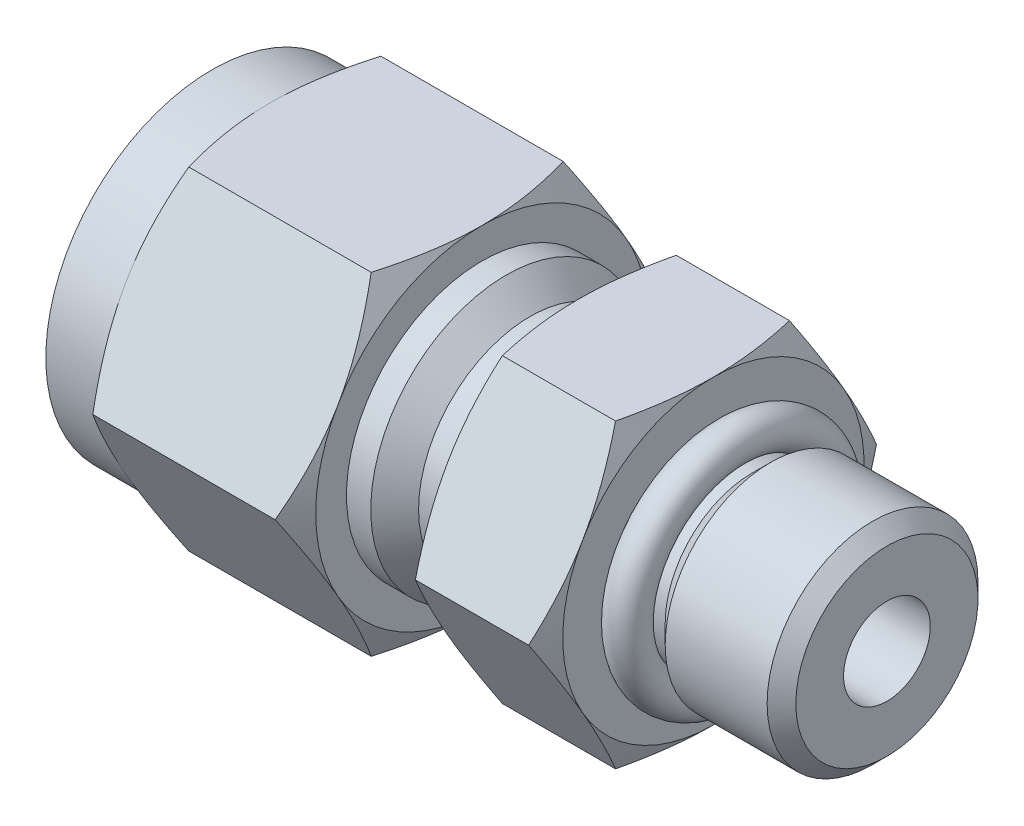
ISO-10303-21;
HEADER;
FILE_DESCRIPTION(('STEP AP214'),'2;1');
FILE_NAME('part.step','',(''),(''),'','','');
FILE_SCHEMA(('AUTOMOTIVE_DESIGN { 1 0 10303 214 1 1 1 1 }'));
ENDSEC;
DATA;
#1=APPLICATION_CONTEXT('core data for automotive mechanical design processes');
#2=APPLICATION_PROTOCOL_DEFINITION('international standard','automotive_design',2000,#1);
#3=PRODUCT_CONTEXT('',#1,'mechanical');
#4=PRODUCT('Part','Part','',(#3));
#5=PRODUCT_RELATED_PRODUCT_CATEGORY('part','',(#4));
#6=PRODUCT_DEFINITION_FORMATION('','',#4);
#7=PRODUCT_DEFINITION_CONTEXT('part definition',#1,'design');
#8=PRODUCT_DEFINITION('design','',#6,#7);
#9=PRODUCT_DEFINITION_SHAPE('','',#8);
#10=(LENGTH_UNIT() NAMED_UNIT(*) SI_UNIT(.MILLI.,.METRE.));
#11=(NAMED_UNIT(*) PLANE_ANGLE_UNIT() SI_UNIT($,.RADIAN.));
#12=(NAMED_UNIT(*) SI_UNIT($,.STERADIAN.) SOLID_ANGLE_UNIT());
#13=UNCERTAINTY_MEASURE_WITH_UNIT(LENGTH_MEASURE(1.E-05),#10,'distance_accuracy_value','');
#14=(GEOMETRIC_REPRESENTATION_CONTEXT(3) GLOBAL_UNCERTAINTY_ASSIGNED_CONTEXT((#13)) GLOBAL_UNIT_ASSIGNED_CONTEXT((#10,
#11,#12)) REPRESENTATION_CONTEXT('',''));
#15=CARTESIAN_POINT('',(0.,0.,0.));
#16=DIRECTION('',(0.,0.,1.));
#17=DIRECTION('',(1.,0.,0.));
#18=AXIS2_PLACEMENT_3D('',#15,#16,#17);
#19=CARTESIAN_POINT('',(-16.2560000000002,0.,-9.16543552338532));
#20=DIRECTION('',(0.,-0.5,-0.866025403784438));
#21=DIRECTION('',(0.,0.866025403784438,-0.5));
#22=AXIS2_PLACEMENT_3D('',#19,#20,#21);
#23=PLANE('',#22);
#24=CARTESIAN_POINT('',(-16.2560000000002,-3.96874999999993,-6.87407664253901));
#25=CARTESIAN_POINT('',(-16.2560229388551,-3.80136405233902,-6.97071696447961));
#26=CARTESIAN_POINT('',(-16.2527085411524,-3.63398282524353,-7.06735456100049));
#27=CARTESIAN_POINT('',(-16.2395748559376,-3.29943036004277,-7.2605085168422));
#28=CARTESIAN_POINT('',(-16.2297563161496,-3.13225910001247,-7.35702488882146));
#29=CARTESIAN_POINT('',(-16.2038272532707,-2.79884399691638,-7.54952218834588));
#30=CARTESIAN_POINT('',(-16.1877377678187,-2.6325989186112,-7.64550382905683));
#31=CARTESIAN_POINT('',(-16.1495783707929,-2.30062606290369,-7.8371684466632));
#32=CARTESIAN_POINT('',(-16.127508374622,-2.1348982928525,-7.93285141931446));
#33=CARTESIAN_POINT('',(-16.052924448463,-1.63894333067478,-8.21919115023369));
#34=CARTESIAN_POINT('',(-15.9920133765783,-1.30966132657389,-8.40930220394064));
#35=CARTESIAN_POINT('',(-15.8511332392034,-0.652994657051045,-8.78842888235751));
#36=CARTESIAN_POINT('',(-15.7711005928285,-0.325620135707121,-8.97743865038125));
#37=CARTESIAN_POINT('',(-15.6834042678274,-2.26661189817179E-08,-9.16543551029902));
#38=B_SPLINE_CURVE_WITH_KNOTS('',3,(#24,#25,#26,#27,#28,#29,#30,#31,#32,#33,#34,#35,#36,#37),
.UNSPECIFIED.,.F.,.F.,(4,2,2,2,2,2,4),(0.,0.579804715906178,1.1595427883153,1.7373524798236,
2.31517034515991,3.4698244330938,4.62837262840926),.UNSPECIFIED.);
#39=CARTESIAN_POINT('',(-16.2560000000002,-3.96874999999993,-6.87407664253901));
#40=VERTEX_POINT('',#39);
#41=CARTESIAN_POINT('',(-15.6834042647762,1.13331843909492E-08,-9.16543551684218));
#42=VERTEX_POINT('',#41);
#43=EDGE_CURVE('E381',#40,#42,#38,.T.);
#44=ORIENTED_EDGE('',*,*,#43,.T.);
#45=DIRECTION('',(1.,0.,0.));
#46=VECTOR('',#45,1.);
#47=CARTESIAN_POINT('',(-16.2560000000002,0.,-9.16543552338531));
#48=LINE('',#47,#46);
#49=CARTESIAN_POINT('',(-9.71659572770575,-3.92597759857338E-08,-9.16543550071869));
#50=VERTEX_POINT('',#49);
#51=EDGE_CURVE('E425',#50,#42,#48,.F.);
#52=ORIENTED_EDGE('',*,*,#51,.F.);
#53=CARTESIAN_POINT('',(-9.71659571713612,-7.85194131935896E-08,-9.16543547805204));
#54=CARTESIAN_POINT('',(-9.62889939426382,-0.325620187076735,-8.97743862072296));
#55=CARTESIAN_POINT('',(-9.54886674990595,-0.652994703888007,-8.78842885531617));
#56=CARTESIAN_POINT('',(-9.40798661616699,-1.30966136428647,-8.40930218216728));
#57=CARTESIAN_POINT('',(-9.3470755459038,-1.63894336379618,-8.21919113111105));
#58=CARTESIAN_POINT('',(-9.2724916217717,-2.13489831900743,-7.9328514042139));
#59=CARTESIAN_POINT('',(-9.25042162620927,-2.30062608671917,-7.83716843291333));
#60=CARTESIAN_POINT('',(-9.21226223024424,-2.63259893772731,-7.64550381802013));
#61=CARTESIAN_POINT('',(-9.19617274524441,-2.7988440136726,-7.54952217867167));
#62=CARTESIAN_POINT('',(-9.17024368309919,-3.13225911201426,-7.35702488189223));
#63=CARTESIAN_POINT('',(-9.16042514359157,-3.29943036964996,-7.26050851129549));
#64=CARTESIAN_POINT('',(-9.14729145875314,-3.63398283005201,-7.06735455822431));
#65=CARTESIAN_POINT('',(-9.14397706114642,-3.8013640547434,-6.97071696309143));
#66=CARTESIAN_POINT('',(-9.14400000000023,-3.96874999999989,-6.874076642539));
#67=B_SPLINE_CURVE_WITH_KNOTS('',3,(#53,#54,#55,#56,#57,#58,#59,#60,#61,#62,#63,#64,#65,#66),
.UNSPECIFIED.,.F.,.F.,(4,2,2,2,2,2,4),(0.,1.1585481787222,2.31320225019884,2.89102010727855,
3.46882979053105,4.04856785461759,4.62837256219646),.UNSPECIFIED.);
#68=CARTESIAN_POINT('',(-9.14400000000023,-3.96874999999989,-6.874076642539));
#69=VERTEX_POINT('',#68);
#70=EDGE_CURVE('E361',#50,#69,#67,.T.);
#71=ORIENTED_EDGE('',*,*,#70,.T.);
#72=CARTESIAN_POINT('',(-9.14400000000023,-3.96874999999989,-6.874076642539));
#73=CARTESIAN_POINT('',(-9.14397706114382,-4.13613595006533,-6.77743631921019));
#74=CARTESIAN_POINT('',(-9.14729145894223,-4.30351717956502,-6.68079872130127));
#75=CARTESIAN_POINT('',(-9.16042514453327,-4.63806964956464,-6.48764476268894));
#76=CARTESIAN_POINT('',(-9.17024368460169,-4.80524091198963,-6.3911283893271));
#77=CARTESIAN_POINT('',(-9.19617274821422,-5.1386560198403,-6.19863108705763));
#78=CARTESIAN_POINT('',(-9.21226223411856,-5.30490110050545,-6.10264944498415));
#79=CARTESIAN_POINT('',(-9.25042163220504,-5.63687396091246,-5.91098482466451));
#80=CARTESIAN_POINT('',(-9.27249162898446,-5.80260173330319,-5.81530185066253));
#81=CARTESIAN_POINT('',(-9.34707555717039,-6.29855670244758,-5.52896211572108));
#82=CARTESIAN_POINT('',(-9.40798663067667,-6.62783871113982,-5.33885105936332));
#83=CARTESIAN_POINT('',(-9.54886677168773,-7.28450538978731,-4.95972437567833));
#84=CARTESIAN_POINT('',(-9.62889942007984,-7.611879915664,-4.77071460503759));
#85=CARTESIAN_POINT('',(-9.71659574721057,-7.93750003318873,-4.5827177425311));
#86=B_SPLINE_CURVE_WITH_KNOTS('',3,(#72,#73,#74,#75,#76,#77,#78,#79,#80,#81,#82,#83,#84,#85),
.UNSPECIFIED.,.F.,.F.,(4,2,2,2,2,2,4),(0.,0.579804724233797,1.15954280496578,1.73735250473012,
2.31517037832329,3.46982448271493,4.62837269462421),.UNSPECIFIED.);
#87=CARTESIAN_POINT('',(-9.71659572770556,-7.93749999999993,-4.5827177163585));
#88=VERTEX_POINT('',#87);
#89=EDGE_CURVE('E822',#69,#88,#86,.T.);
#90=ORIENTED_EDGE('',*,*,#89,.T.);
#91=DIRECTION('',(1.,0.,0.));
#92=VECTOR('',#91,1.);
#93=CARTESIAN_POINT('',(-16.2560000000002,-7.93749999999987,-4.58271776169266));
#94=LINE('',#93,#92);
#95=CARTESIAN_POINT('',(-15.6834042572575,-7.93750001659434,-4.58271775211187));
#96=VERTEX_POINT('',#95);
#97=EDGE_CURVE('E414',#96,#88,#94,.T.);
#98=ORIENTED_EDGE('',*,*,#97,.F.);
#99=CARTESIAN_POINT('',(-15.6834042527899,-7.93750003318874,-4.58271774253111));
#100=CARTESIAN_POINT('',(-15.7711005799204,-7.61187991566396,-4.77071460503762));
#101=CARTESIAN_POINT('',(-15.8511332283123,-7.28450538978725,-4.95972437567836));
#102=CARTESIAN_POINT('',(-15.9920133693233,-6.62783871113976,-5.33885105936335));
#103=CARTESIAN_POINT('',(-16.0529244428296,-6.29855670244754,-5.52896211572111));
#104=CARTESIAN_POINT('',(-16.1275083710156,-5.80260173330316,-5.81530185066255));
#105=CARTESIAN_POINT('',(-16.149578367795,-5.63687396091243,-5.91098482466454));
#106=CARTESIAN_POINT('',(-16.1877377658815,-5.30490110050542,-6.10264944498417));
#107=CARTESIAN_POINT('',(-16.2038272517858,-5.13865601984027,-6.19863108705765));
#108=CARTESIAN_POINT('',(-16.2297563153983,-4.80524091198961,-6.39112838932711));
#109=CARTESIAN_POINT('',(-16.2395748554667,-4.63806964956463,-6.48764476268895));
#110=CARTESIAN_POINT('',(-16.2527085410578,-4.30351717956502,-6.68079872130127));
#111=CARTESIAN_POINT('',(-16.2560229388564,-4.13613595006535,-6.7774363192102));
#112=CARTESIAN_POINT('',(-16.2560000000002,-3.96874999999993,-6.87407664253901));
#113=B_SPLINE_CURVE_WITH_KNOTS('',3,(#99,#100,#101,#102,#103,#104,#105,#106,#107,#108,#109,#110,
#111,#112),.UNSPECIFIED.,.F.,.F.,(4,2,2,2,2,2,4),(0.,1.15854821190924,2.31320231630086,
2.89102018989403,3.46882988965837,4.04856797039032,4.62837269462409),.UNSPECIFIED.);
#114=EDGE_CURVE('E382',#96,#40,#113,.T.);
#115=ORIENTED_EDGE('',*,*,#114,.T.);
#116=EDGE_LOOP('',(#44,#52,#71,#90,#98,#115));
#117=FACE_BOUND('',#116,.T.);
#118=ADVANCED_FACE('F16',(#117),#23,.T.);
#119=CARTESIAN_POINT('',(-16.2560000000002,7.93750000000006,-4.58271776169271));
#120=DIRECTION('',(0.,0.5,-0.86602540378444));
#121=DIRECTION('',(0.,0.86602540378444,0.5));
#122=AXIS2_PLACEMENT_3D('',#119,#120,#121);
#123=PLANE('',#122);
#124=CARTESIAN_POINT('',(-16.2560000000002,3.9687500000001,-6.87407664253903));
#125=CARTESIAN_POINT('',(-16.2560229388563,4.1361359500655,-6.7774363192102));
#126=CARTESIAN_POINT('',(-16.2527085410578,4.30351717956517,-6.68079872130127));
#127=CARTESIAN_POINT('',(-16.2395748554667,4.63806964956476,-6.48764476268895));
#128=CARTESIAN_POINT('',(-16.2297563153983,4.80524091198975,-6.39112838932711));
#129=CARTESIAN_POINT('',(-16.2038272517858,5.1386560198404,-6.19863108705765));
#130=CARTESIAN_POINT('',(-16.1877377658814,5.30490110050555,-6.10264944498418));
#131=CARTESIAN_POINT('',(-16.1495783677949,5.63687396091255,-5.91098482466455));
#132=CARTESIAN_POINT('',(-16.1275083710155,5.80260173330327,-5.81530185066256));
#133=CARTESIAN_POINT('',(-16.0529244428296,6.29855670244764,-5.52896211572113));
#134=CARTESIAN_POINT('',(-15.9920133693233,6.62783871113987,-5.33885105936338));
#135=CARTESIAN_POINT('',(-15.8511332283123,7.28450538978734,-4.95972437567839));
#136=CARTESIAN_POINT('',(-15.7711005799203,7.61187991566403,-4.77071460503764));
#137=CARTESIAN_POINT('',(-15.6834042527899,7.93750003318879,-4.5827177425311));
#138=B_SPLINE_CURVE_WITH_KNOTS('',3,(#124,#125,#126,#127,#128,#129,#130,#131,#132,#133,#134,
#135,#136,#137),.UNSPECIFIED.,.F.,.F.,(4,2,2,2,2,2,4),(0.,0.579804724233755,1.1595428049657,
1.73735250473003,2.31517037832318,3.46982448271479,4.628372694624),.UNSPECIFIED.);
#139=CARTESIAN_POINT('',(-16.2560000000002,3.9687500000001,-6.87407664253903));
#140=VERTEX_POINT('',#139);
#141=CARTESIAN_POINT('',(-15.6834042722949,7.93750000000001,-4.58271771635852));
#142=VERTEX_POINT('',#141);
#143=EDGE_CURVE('E299',#140,#142,#138,.T.);
#144=ORIENTED_EDGE('',*,*,#143,.T.);
#145=DIRECTION('',(1.,0.,0.));
#146=VECTOR('',#145,1.);
#147=CARTESIAN_POINT('',(-16.2560000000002,7.93750000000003,-4.58271776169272));
#148=LINE('',#147,#146);
#149=CARTESIAN_POINT('',(-9.71659574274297,7.9375000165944,-4.58271775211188));
#150=VERTEX_POINT('',#149);
#151=EDGE_CURVE('E423',#150,#142,#148,.F.);
#152=ORIENTED_EDGE('',*,*,#151,.F.);
#153=CARTESIAN_POINT('',(-9.71659574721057,7.93750003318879,-4.58271774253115));
#154=CARTESIAN_POINT('',(-9.62889942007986,7.61187991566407,-4.77071460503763));
#155=CARTESIAN_POINT('',(-9.54886677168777,7.28450538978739,-4.95972437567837));
#156=CARTESIAN_POINT('',(-9.40798663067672,6.62783871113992,-5.33885105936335));
#157=CARTESIAN_POINT('',(-9.34707555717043,6.29855670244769,-5.5289621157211));
#158=CARTESIAN_POINT('',(-9.2724916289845,5.80260173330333,-5.81530185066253));
#159=CARTESIAN_POINT('',(-9.25042163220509,5.6368739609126,-5.91098482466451));
#160=CARTESIAN_POINT('',(-9.2122622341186,5.3049011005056,-6.10264944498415));
#161=CARTESIAN_POINT('',(-9.19617274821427,5.13865601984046,-6.19863108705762));
#162=CARTESIAN_POINT('',(-9.17024368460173,4.8052409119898,-6.39112838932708));
#163=CARTESIAN_POINT('',(-9.16042514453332,4.63806964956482,-6.48764476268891));
#164=CARTESIAN_POINT('',(-9.14729145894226,4.30351717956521,-6.68079872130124));
#165=CARTESIAN_POINT('',(-9.14397706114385,4.13613595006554,-6.77743631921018));
#166=CARTESIAN_POINT('',(-9.14400000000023,3.96875000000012,-6.87407664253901));
#167=B_SPLINE_CURVE_WITH_KNOTS('',3,(#153,#154,#155,#156,#157,#158,#159,#160,#161,#162,#163,
#164,#165,#166),.UNSPECIFIED.,.F.,.F.,(4,2,2,2,2,2,4),(0.,1.15854821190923,2.31320231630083,
2.89102018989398,3.4688298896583,4.04856797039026,4.62837269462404),.UNSPECIFIED.);
#168=CARTESIAN_POINT('',(-9.14400000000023,3.96875000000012,-6.87407664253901));
#169=VERTEX_POINT('',#168);
#170=EDGE_CURVE('E326',#150,#169,#167,.T.);
#171=ORIENTED_EDGE('',*,*,#170,.T.);
#172=CARTESIAN_POINT('',(-9.14400000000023,3.96875000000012,-6.87407664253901));
#173=CARTESIAN_POINT('',(-9.14397706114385,3.80136404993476,-6.9707169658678));
#174=CARTESIAN_POINT('',(-9.14729145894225,3.63398282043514,-7.06735456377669));
#175=CARTESIAN_POINT('',(-9.1604251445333,3.29943035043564,-7.26050852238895));
#176=CARTESIAN_POINT('',(-9.1702436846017,3.13225908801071,-7.35702489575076));
#177=CARTESIAN_POINT('',(-9.19617274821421,2.79884398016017,-7.54952219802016));
#178=CARTESIAN_POINT('',(-9.21226223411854,2.63259889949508,-7.6455038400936));
#179=CARTESIAN_POINT('',(-9.250421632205,2.30062603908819,-7.83716846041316));
#180=CARTESIAN_POINT('',(-9.27249162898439,2.13489826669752,-7.93285143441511));
#181=CARTESIAN_POINT('',(-9.34707555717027,1.63894329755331,-8.21919116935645));
#182=CARTESIAN_POINT('',(-9.40798663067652,1.3096612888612,-8.40930222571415));
#183=CARTESIAN_POINT('',(-9.54886677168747,0.652994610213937,-8.78842890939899));
#184=CARTESIAN_POINT('',(-9.62889942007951,0.325620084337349,-8.97743868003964));
#185=CARTESIAN_POINT('',(-9.71659574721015,-3.3187307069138E-08,-9.16543554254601));
#186=B_SPLINE_CURVE_WITH_KNOTS('',3,(#172,#173,#174,#175,#176,#177,#178,#179,#180,#181,#182,
#183,#184,#185),.UNSPECIFIED.,.F.,.F.,(4,2,2,2,2,2,4),(0.,0.579804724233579,1.15954280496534,
1.73735250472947,2.31517037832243,3.46982448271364,4.62837269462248),.UNSPECIFIED.);
#187=EDGE_CURVE('E355',#169,#50,#186,.T.);
#188=ORIENTED_EDGE('',*,*,#187,.T.);
#189=ORIENTED_EDGE('',*,*,#51,.T.);
#190=CARTESIAN_POINT('',(-15.6834042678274,2.2666112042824E-08,-9.16543551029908));
#191=CARTESIAN_POINT('',(-15.7711005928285,0.325620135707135,-8.97743865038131));
#192=CARTESIAN_POINT('',(-15.8511332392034,0.652994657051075,-8.78842888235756));
#193=CARTESIAN_POINT('',(-15.9920133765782,1.30966132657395,-8.40930220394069));
#194=CARTESIAN_POINT('',(-16.052924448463,1.63894333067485,-8.21919115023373));
#195=CARTESIAN_POINT('',(-16.127508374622,2.13489829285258,-7.93285141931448));
#196=CARTESIAN_POINT('',(-16.1495783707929,2.30062606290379,-7.83716844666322));
#197=CARTESIAN_POINT('',(-16.1877377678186,2.6325989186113,-7.64550382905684));
#198=CARTESIAN_POINT('',(-16.2038272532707,2.79884399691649,-7.54952218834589));
#199=CARTESIAN_POINT('',(-16.2297563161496,3.13225910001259,-7.35702488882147));
#200=CARTESIAN_POINT('',(-16.2395748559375,3.2994303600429,-7.2605085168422));
#201=CARTESIAN_POINT('',(-16.2527085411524,3.63398282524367,-7.06735456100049));
#202=CARTESIAN_POINT('',(-16.256022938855,3.80136405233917,-6.97071696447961));
#203=CARTESIAN_POINT('',(-16.2560000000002,3.9687500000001,-6.87407664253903));
#204=B_SPLINE_CURVE_WITH_KNOTS('',3,(#190,#191,#192,#193,#194,#195,#196,#197,#198,#199,#200,
#201,#202,#203),.UNSPECIFIED.,.F.,.F.,(4,2,2,2,2,2,4),(0.,1.1585481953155,2.31320228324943,
2.89102014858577,3.46882984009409,4.04856791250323,4.62837262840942),.UNSPECIFIED.);
#205=EDGE_CURVE('E374',#42,#140,#204,.T.);
#206=ORIENTED_EDGE('',*,*,#205,.T.);
#207=EDGE_LOOP('',(#144,#152,#171,#188,#189,#206));
#208=FACE_BOUND('',#207,.T.);
#209=ADVANCED_FACE('F366',(#208),#123,.T.);
#210=CARTESIAN_POINT('',(-16.256,7.93749999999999,0.));
#211=DIRECTION('',(0.,1.,0.));
#212=DIRECTION('',(0.,0.,1.));
#213=AXIS2_PLACEMENT_3D('',#210,#211,#212);
#214=PLANE('',#213);
#215=DIRECTION('',(1.,0.,0.));
#216=VECTOR('',#215,1.);
#217=CARTESIAN_POINT('',(-16.256,7.93749999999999,4.58271776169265));
#218=LINE('',#217,#216);
#219=CARTESIAN_POINT('',(-9.71659574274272,7.93750000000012,4.58271778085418));
#220=VERTEX_POINT('',#219);
#221=CARTESIAN_POINT('',(-15.6834042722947,7.93749996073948,4.58271778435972));
#222=VERTEX_POINT('',#221);
#223=EDGE_CURVE('E421',#220,#222,#218,.F.);
#224=ORIENTED_EDGE('',*,*,#223,.F.);
#225=CARTESIAN_POINT('',(-9.71659574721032,7.93749999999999,4.58271780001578));
#226=CARTESIAN_POINT('',(-9.62889942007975,7.93749999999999,4.20672407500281));
#227=CARTESIAN_POINT('',(-9.54886677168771,7.93749999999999,3.82870453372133));
#228=CARTESIAN_POINT('',(-9.4079866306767,7.93749999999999,3.07045116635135));
#229=CARTESIAN_POINT('',(-9.34707555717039,7.93749999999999,2.69022905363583));
#230=CARTESIAN_POINT('',(-9.27249162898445,7.93749999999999,2.11754958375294));
#231=CARTESIAN_POINT('',(-9.25042163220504,7.93749999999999,1.92618363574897));
#232=CARTESIAN_POINT('',(-9.21226223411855,7.93749999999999,1.54285439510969));
#233=CARTESIAN_POINT('',(-9.19617274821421,7.93749999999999,1.35089111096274));
#234=CARTESIAN_POINT('',(-9.17024368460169,7.93749999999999,0.965896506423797));
#235=CARTESIAN_POINT('',(-9.16042514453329,7.93749999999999,0.772863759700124));
#236=CARTESIAN_POINT('',(-9.1472914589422,7.93749999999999,0.386555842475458));
#237=CARTESIAN_POINT('',(-9.14397706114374,7.93749999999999,0.193280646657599));
#238=CARTESIAN_POINT('',(-9.14400000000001,7.93749999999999,0.));
#239=B_SPLINE_CURVE_WITH_KNOTS('',3,(#225,#226,#227,#228,#229,#230,#231,#232,#233,#234,#235,
#236,#237,#238),.UNSPECIFIED.,.F.,.F.,(4,2,2,2,2,2,4),(0.,1.15854821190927,2.31320231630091,
2.89102018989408,3.46882988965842,4.04856797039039,4.62837269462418),.UNSPECIFIED.);
#240=CARTESIAN_POINT('',(-9.14400000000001,7.93750000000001,0.));
#241=VERTEX_POINT('',#240);
#242=EDGE_CURVE('E325',#220,#241,#239,.T.);
#243=ORIENTED_EDGE('',*,*,#242,.T.);
#244=CARTESIAN_POINT('',(-9.14400000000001,7.93749999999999,0.));
#245=CARTESIAN_POINT('',(-9.14397706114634,7.93749999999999,-0.193280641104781));
#246=CARTESIAN_POINT('',(-9.14729145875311,7.93749999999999,-0.386555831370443));
#247=CARTESIAN_POINT('',(-9.16042514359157,7.93749999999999,-0.77286373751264));
#248=CARTESIAN_POINT('',(-9.17024368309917,7.93749999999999,-0.965896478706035));
#249=CARTESIAN_POINT('',(-9.19617274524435,7.93749999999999,-1.35089107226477));
#250=CARTESIAN_POINT('',(-9.21226223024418,7.93749999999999,-1.54285435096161));
#251=CARTESIAN_POINT('',(-9.25042162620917,7.93749999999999,-1.92618358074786));
#252=CARTESIAN_POINT('',(-9.27249162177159,7.93749999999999,-2.11754952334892));
#253=CARTESIAN_POINT('',(-9.34707554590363,7.93749999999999,-2.69022897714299));
#254=CARTESIAN_POINT('',(-9.40798661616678,7.93749999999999,-3.0704510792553));
#255=CARTESIAN_POINT('',(-9.54886674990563,7.93749999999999,-3.82870442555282));
#256=CARTESIAN_POINT('',(-9.62889939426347,7.9375,-4.20672395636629));
#257=CARTESIAN_POINT('',(-9.71659571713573,7.93750000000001,-4.58271767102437));
#258=B_SPLINE_CURVE_WITH_KNOTS('',3,(#244,#245,#246,#247,#248,#249,#250,#251,#252,#253,#254,
#255,#256,#257),.UNSPECIFIED.,.F.,.F.,(4,2,2,2,2,2,4),(0.,0.579804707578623,1.15954277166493,
1.7373524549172,2.31517031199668,3.46982438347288,4.62837256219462),.UNSPECIFIED.);
#259=EDGE_CURVE('E349',#241,#150,#258,.T.);
#260=ORIENTED_EDGE('',*,*,#259,.T.);
#261=ORIENTED_EDGE('',*,*,#151,.T.);
#262=CARTESIAN_POINT('',(-15.6834042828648,7.93750000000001,-4.58271767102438));
#263=CARTESIAN_POINT('',(-15.7711006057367,7.9375,-4.20672395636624));
#264=CARTESIAN_POINT('',(-15.8511332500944,7.93749999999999,-3.82870442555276));
#265=CARTESIAN_POINT('',(-15.9920133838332,7.93749999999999,-3.07045107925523));
#266=CARTESIAN_POINT('',(-16.0529244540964,7.93749999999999,-2.69022897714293));
#267=CARTESIAN_POINT('',(-16.1275083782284,7.93749999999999,-2.11754952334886));
#268=CARTESIAN_POINT('',(-16.1495783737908,7.93749999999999,-1.9261835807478));
#269=CARTESIAN_POINT('',(-16.1877377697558,7.93749999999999,-1.54285435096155));
#270=CARTESIAN_POINT('',(-16.2038272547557,7.93749999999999,-1.35089107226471));
#271=CARTESIAN_POINT('',(-16.2297563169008,7.93749999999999,-0.965896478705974));
#272=CARTESIAN_POINT('',(-16.2395748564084,7.93749999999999,-0.77286373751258));
#273=CARTESIAN_POINT('',(-16.2527085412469,7.93749999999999,-0.386555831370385));
#274=CARTESIAN_POINT('',(-16.2560229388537,7.93749999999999,-0.193280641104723));
#275=CARTESIAN_POINT('',(-16.256,7.93749999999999,0.));
#276=B_SPLINE_CURVE_WITH_KNOTS('',3,(#262,#263,#264,#265,#266,#267,#268,#269,#270,#271,#272,
#273,#274,#275),.UNSPECIFIED.,.F.,.F.,(4,2,2,2,2,2,4),(0.,1.15854817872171,2.31320225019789,
2.89102010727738,3.46882979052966,4.04856785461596,4.62837256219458),.UNSPECIFIED.);
#277=CARTESIAN_POINT('',(-16.256,7.93749999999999,0.));
#278=VERTEX_POINT('',#277);
#279=EDGE_CURVE('E831',#142,#278,#276,.T.);
#280=ORIENTED_EDGE('',*,*,#279,.T.);
#281=CARTESIAN_POINT('',(-16.256,7.93749999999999,0.));
#282=CARTESIAN_POINT('',(-16.2560229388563,7.93749999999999,0.193280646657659));
#283=CARTESIAN_POINT('',(-16.2527085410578,7.93749999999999,0.386555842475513));
#284=CARTESIAN_POINT('',(-16.2395748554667,7.93749999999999,0.772863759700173));
#285=CARTESIAN_POINT('',(-16.2297563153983,7.93749999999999,0.965896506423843));
#286=CARTESIAN_POINT('',(-16.2038272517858,7.93749999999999,1.35089111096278));
#287=CARTESIAN_POINT('',(-16.1877377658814,7.93749999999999,1.54285439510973));
#288=CARTESIAN_POINT('',(-16.149578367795,7.93749999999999,1.926183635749));
#289=CARTESIAN_POINT('',(-16.1275083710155,7.93749999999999,2.11754958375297));
#290=CARTESIAN_POINT('',(-16.0529244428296,7.93749999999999,2.69022905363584));
#291=CARTESIAN_POINT('',(-15.9920133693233,7.93749999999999,3.07045116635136));
#292=CARTESIAN_POINT('',(-15.8511332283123,7.93749999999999,3.82870453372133));
#293=CARTESIAN_POINT('',(-15.7711005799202,7.93749999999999,4.2067240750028));
#294=CARTESIAN_POINT('',(-15.6834042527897,7.93749999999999,4.58271780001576));
#295=B_SPLINE_CURVE_WITH_KNOTS('',3,(#281,#282,#283,#284,#285,#286,#287,#288,#289,#290,#291,
#292,#293,#294),.UNSPECIFIED.,.F.,.F.,(4,2,2,2,2,2,4),(0.,0.579804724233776,1.15954280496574,
1.73735250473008,2.31517037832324,3.46982448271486,4.6283726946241),.UNSPECIFIED.);
#296=EDGE_CURVE('E210',#278,#222,#295,.T.);
#297=ORIENTED_EDGE('',*,*,#296,.T.);
#298=EDGE_LOOP('',(#224,#243,#260,#261,#280,#297));
#299=FACE_BOUND('',#298,.T.);
#300=ADVANCED_FACE('F307',(#299),#214,.T.);
#301=CARTESIAN_POINT('',(-16.256,0.,9.1654355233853));
#302=DIRECTION('',(0.,0.5,0.866025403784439));
#303=DIRECTION('',(0.,-0.866025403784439,0.5));
#304=AXIS2_PLACEMENT_3D('',#301,#302,#303);
#305=PLANE('',#304);
#306=DIRECTION('',(1.,0.,0.));
#307=VECTOR('',#306,1.);
#308=CARTESIAN_POINT('',(-16.256,0.,9.1654355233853));
#309=LINE('',#308,#307);
#310=CARTESIAN_POINT('',(-9.71659573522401,1.13330664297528E-08,9.1654355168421));
#311=VERTEX_POINT('',#310);
#312=CARTESIAN_POINT('',(-15.6834042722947,-3.92605115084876E-08,9.16543550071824));
#313=VERTEX_POINT('',#312);
#314=EDGE_CURVE('E206',#311,#313,#309,.F.);
#315=ORIENTED_EDGE('',*,*,#314,.F.);
#316=CARTESIAN_POINT('',(-9.7165957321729,2.26662438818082E-08,9.16543551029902));
#317=CARTESIAN_POINT('',(-9.62889940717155,0.325620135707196,8.97743865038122));
#318=CARTESIAN_POINT('',(-9.54886676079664,0.652994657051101,8.78842888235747));
#319=CARTESIAN_POINT('',(-9.40798662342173,1.30966132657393,8.40930220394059));
#320=CARTESIAN_POINT('',(-9.347075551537,1.63894333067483,8.21919115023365));
#321=CARTESIAN_POINT('',(-9.27249162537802,2.13489829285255,7.93285141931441));
#322=CARTESIAN_POINT('',(-9.25042162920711,2.30062606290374,7.83716844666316));
#323=CARTESIAN_POINT('',(-9.21226223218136,2.63259891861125,7.64550382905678));
#324=CARTESIAN_POINT('',(-9.19617274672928,2.79884399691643,7.54952218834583));
#325=CARTESIAN_POINT('',(-9.17024368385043,3.13225910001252,7.35702488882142));
#326=CARTESIAN_POINT('',(-9.16042514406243,3.29943036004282,7.26050851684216));
#327=CARTESIAN_POINT('',(-9.14729145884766,3.63398282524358,7.06735456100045));
#328=CARTESIAN_POINT('',(-9.14397706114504,3.80136405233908,6.97071696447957));
#329=CARTESIAN_POINT('',(-9.14400000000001,3.96875,6.87407664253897));
#330=B_SPLINE_CURVE_WITH_KNOTS('',3,(#316,#317,#318,#319,#320,#321,#322,#323,#324,#325,#326,
#327,#328,#329),.UNSPECIFIED.,.F.,.F.,(4,2,2,2,2,2,4),(0.,1.15854819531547,2.31320228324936,
2.89102014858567,3.46882984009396,4.04856791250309,4.62837262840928),.UNSPECIFIED.);
#331=CARTESIAN_POINT('',(-9.14400000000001,3.96875,6.87407664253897));
#332=VERTEX_POINT('',#331);
#333=EDGE_CURVE('E312',#311,#332,#330,.T.);
#334=ORIENTED_EDGE('',*,*,#333,.T.);
#335=CARTESIAN_POINT('',(-9.14400000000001,3.96875,6.87407664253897));
#336=CARTESIAN_POINT('',(-9.14397706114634,4.13613594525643,6.77743632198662));
#337=CARTESIAN_POINT('',(-9.14729145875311,4.30351716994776,6.68079872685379));
#338=CARTESIAN_POINT('',(-9.16042514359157,4.63806963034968,6.48764477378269));
#339=CARTESIAN_POINT('',(-9.17024368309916,4.80524088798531,6.39112840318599));
#340=CARTESIAN_POINT('',(-9.19617274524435,5.13865598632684,6.19863110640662));
#341=CARTESIAN_POINT('',(-9.21226223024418,5.30490106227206,6.1026494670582));
#342=CARTESIAN_POINT('',(-9.25042162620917,5.63687391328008,5.91098485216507));
#343=CARTESIAN_POINT('',(-9.27249162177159,5.80260168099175,5.81530188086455));
#344=CARTESIAN_POINT('',(-9.34707554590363,6.29855663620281,5.52896215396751));
#345=CARTESIAN_POINT('',(-9.40798661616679,6.62783863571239,5.33885110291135));
#346=CARTESIAN_POINT('',(-9.5488667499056,7.28450529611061,4.95972442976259));
#347=CARTESIAN_POINT('',(-9.62889939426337,7.61187981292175,4.77071466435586));
#348=CARTESIAN_POINT('',(-9.71659571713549,7.93749992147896,4.58271780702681));
#349=B_SPLINE_CURVE_WITH_KNOTS('',3,(#335,#336,#337,#338,#339,#340,#341,#342,#343,#344,#345,
#346,#347,#348),.UNSPECIFIED.,.F.,.F.,(4,2,2,2,2,2,4),(0.,0.579804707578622,1.15954277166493,
1.7373524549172,2.31517031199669,3.46982438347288,4.62837256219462),.UNSPECIFIED.);
#350=EDGE_CURVE('E318',#332,#220,#349,.T.);
#351=ORIENTED_EDGE('',*,*,#350,.T.);
#352=ORIENTED_EDGE('',*,*,#223,.T.);
#353=CARTESIAN_POINT('',(-15.6834042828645,7.93749992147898,4.58271780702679));
#354=CARTESIAN_POINT('',(-15.7711006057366,7.61187981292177,4.77071466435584));
#355=CARTESIAN_POINT('',(-15.8511332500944,7.28450529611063,4.95972442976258));
#356=CARTESIAN_POINT('',(-15.9920133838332,6.6278386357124,5.33885110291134));
#357=CARTESIAN_POINT('',(-16.0529244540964,6.29855663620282,5.5289621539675));
#358=CARTESIAN_POINT('',(-16.1275083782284,5.80260168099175,5.81530188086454));
#359=CARTESIAN_POINT('',(-16.1495783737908,5.63687391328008,5.91098485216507));
#360=CARTESIAN_POINT('',(-16.1877377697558,5.30490106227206,6.1026494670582));
#361=CARTESIAN_POINT('',(-16.2038272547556,5.13865598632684,6.19863110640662));
#362=CARTESIAN_POINT('',(-16.2297563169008,4.80524088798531,6.39112840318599));
#363=CARTESIAN_POINT('',(-16.2395748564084,4.63806963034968,6.48764477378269));
#364=CARTESIAN_POINT('',(-16.2527085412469,4.30351716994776,6.68079872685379));
#365=CARTESIAN_POINT('',(-16.2560229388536,4.13613594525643,6.77743632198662));
#366=CARTESIAN_POINT('',(-16.256,3.96875,6.87407664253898));
#367=B_SPLINE_CURVE_WITH_KNOTS('',3,(#353,#354,#355,#356,#357,#358,#359,#360,#361,#362,#363,
#364,#365,#366),.UNSPECIFIED.,.F.,.F.,(4,2,2,2,2,2,4),(0.,1.15854817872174,2.31320225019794,
2.89102010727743,3.46882979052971,4.04856785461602,4.62837256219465),.UNSPECIFIED.);
#368=CARTESIAN_POINT('',(-16.256,3.96875,6.87407664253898));
#369=VERTEX_POINT('',#368);
#370=EDGE_CURVE('E294',#222,#369,#367,.T.);
#371=ORIENTED_EDGE('',*,*,#370,.T.);
#372=CARTESIAN_POINT('',(-16.256,3.96875,6.87407664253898));
#373=CARTESIAN_POINT('',(-16.2560229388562,3.80136404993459,6.9707169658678));
#374=CARTESIAN_POINT('',(-16.2527085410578,3.63398282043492,7.06735456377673));
#375=CARTESIAN_POINT('',(-16.2395748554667,3.29943035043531,7.26050852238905));
#376=CARTESIAN_POINT('',(-16.2297563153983,3.13225908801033,7.35702489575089));
#377=CARTESIAN_POINT('',(-16.2038272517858,2.79884398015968,7.54952219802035));
#378=CARTESIAN_POINT('',(-16.1877377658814,2.63259889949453,7.64550384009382));
#379=CARTESIAN_POINT('',(-16.1495783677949,2.30062603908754,7.83716846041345));
#380=CARTESIAN_POINT('',(-16.1275083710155,2.13489826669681,7.93285143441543));
#381=CARTESIAN_POINT('',(-16.0529244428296,1.63894329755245,8.21919116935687));
#382=CARTESIAN_POINT('',(-15.9920133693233,1.30966128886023,8.40930222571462));
#383=CARTESIAN_POINT('',(-15.8511332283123,0.652994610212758,8.7884289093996));
#384=CARTESIAN_POINT('',(-15.7711005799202,0.32562008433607,8.97743868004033));
#385=CARTESIAN_POINT('',(-15.6834042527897,-3.31886809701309E-08,9.16543554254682));
#386=B_SPLINE_CURVE_WITH_KNOTS('',3,(#372,#373,#374,#375,#376,#377,#378,#379,#380,#381,#382,
#383,#384,#385),.UNSPECIFIED.,.F.,.F.,(4,2,2,2,2,2,4),(0.,0.579804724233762,1.15954280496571,
1.73735250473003,2.31517037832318,3.46982448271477,4.62837269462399),.UNSPECIFIED.);
#387=EDGE_CURVE('E209',#369,#313,#386,.T.);
#388=ORIENTED_EDGE('',*,*,#387,.T.);
#389=EDGE_LOOP('',(#315,#334,#351,#352,#371,#388));
#390=FACE_BOUND('',#389,.T.);
#391=ADVANCED_FACE('F304',(#390),#305,.T.);
#392=CARTESIAN_POINT('',(-16.2560000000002,-7.93749999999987,-4.58271776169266));
#393=DIRECTION('',(0.,-1.,0.));
#394=DIRECTION('',(0.,0.,-1.));
#395=AXIS2_PLACEMENT_3D('',#392,#393,#394);
#396=PLANE('',#395);
#397=CARTESIAN_POINT('',(-16.256,-7.93749999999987,0.));
#398=CARTESIAN_POINT('',(-16.2560229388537,-7.93749999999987,-0.193280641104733));
#399=CARTESIAN_POINT('',(-16.252708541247,-7.93749999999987,-0.386555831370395));
#400=CARTESIAN_POINT('',(-16.2395748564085,-7.93749999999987,-0.772863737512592));
#401=CARTESIAN_POINT('',(-16.2297563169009,-7.93749999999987,-0.965896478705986));
#402=CARTESIAN_POINT('',(-16.2038272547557,-7.93749999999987,-1.35089107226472));
#403=CARTESIAN_POINT('',(-16.1877377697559,-7.93749999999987,-1.54285435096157));
#404=CARTESIAN_POINT('',(-16.1495783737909,-7.93749999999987,-1.92618358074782));
#405=CARTESIAN_POINT('',(-16.1275083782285,-7.93749999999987,-2.11754952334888));
#406=CARTESIAN_POINT('',(-16.0529244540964,-7.93749999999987,-2.69022897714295));
#407=CARTESIAN_POINT('',(-15.9920133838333,-7.93749999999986,-3.07045107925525));
#408=CARTESIAN_POINT('',(-15.8511332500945,-7.93749999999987,-3.82870442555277));
#409=CARTESIAN_POINT('',(-15.7711006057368,-7.93749999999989,-4.20672395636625));
#410=CARTESIAN_POINT('',(-15.6834042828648,-7.93749999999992,-4.58271767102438));
#411=B_SPLINE_CURVE_WITH_KNOTS('',3,(#397,#398,#399,#400,#401,#402,#403,#404,#405,#406,#407,
#408,#409,#410),.UNSPECIFIED.,.F.,.F.,(4,2,2,2,2,2,4),(0.,0.579804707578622,1.15954277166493,
1.7373524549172,2.31517031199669,3.46982438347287,4.62837256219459),.UNSPECIFIED.);
#412=CARTESIAN_POINT('',(-16.256,-7.93749999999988,0.));
#413=VERTEX_POINT('',#412);
#414=EDGE_CURVE('E400',#413,#96,#411,.T.);
#415=ORIENTED_EDGE('',*,*,#414,.T.);
#416=ORIENTED_EDGE('',*,*,#97,.T.);
#417=CARTESIAN_POINT('',(-9.71659571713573,-7.93749999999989,-4.58271767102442));
#418=CARTESIAN_POINT('',(-9.62889939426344,-7.93749999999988,-4.20672395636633));
#419=CARTESIAN_POINT('',(-9.54886674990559,-7.93749999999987,-3.82870442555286));
#420=CARTESIAN_POINT('',(-9.40798661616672,-7.93749999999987,-3.07045107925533));
#421=CARTESIAN_POINT('',(-9.34707554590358,-7.93749999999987,-2.69022897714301));
#422=CARTESIAN_POINT('',(-9.27249162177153,-7.93749999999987,-2.11754952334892));
#423=CARTESIAN_POINT('',(-9.25042162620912,-7.93749999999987,-1.92618358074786));
#424=CARTESIAN_POINT('',(-9.21226223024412,-7.93749999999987,-1.5428543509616));
#425=CARTESIAN_POINT('',(-9.19617274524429,-7.93749999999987,-1.35089107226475));
#426=CARTESIAN_POINT('',(-9.1702436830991,-7.93749999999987,-0.965896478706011));
#427=CARTESIAN_POINT('',(-9.1604251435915,-7.93749999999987,-0.772863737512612));
#428=CARTESIAN_POINT('',(-9.14729145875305,-7.93749999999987,-0.386555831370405));
#429=CARTESIAN_POINT('',(-9.14397706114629,-7.93749999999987,-0.193280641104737));
#430=CARTESIAN_POINT('',(-9.14399999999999,-7.93749999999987,0.));
#431=B_SPLINE_CURVE_WITH_KNOTS('',3,(#417,#418,#419,#420,#421,#422,#423,#424,#425,#426,#427,
#428,#429,#430),.UNSPECIFIED.,.F.,.F.,(4,2,2,2,2,2,4),(0.,1.15854817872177,2.31320225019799,
2.89102010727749,3.46882979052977,4.04856785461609,4.62837256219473),.UNSPECIFIED.);
#432=CARTESIAN_POINT('',(-9.14399999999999,-7.93749999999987,0.));
#433=VERTEX_POINT('',#432);
#434=EDGE_CURVE('E820',#88,#433,#431,.T.);
#435=ORIENTED_EDGE('',*,*,#434,.T.);
#436=CARTESIAN_POINT('',(-9.14399999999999,-7.93749999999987,0.));
#437=CARTESIAN_POINT('',(-9.14397706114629,-7.93749999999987,0.193280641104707));
#438=CARTESIAN_POINT('',(-9.14729145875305,-7.93749999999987,0.386555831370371));
#439=CARTESIAN_POINT('',(-9.1604251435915,-7.93749999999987,0.772863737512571));
#440=CARTESIAN_POINT('',(-9.1702436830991,-7.93749999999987,0.965896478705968));
#441=CARTESIAN_POINT('',(-9.19617274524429,-7.93749999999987,1.3508910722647));
#442=CARTESIAN_POINT('',(-9.21226223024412,-7.93749999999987,1.54285435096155));
#443=CARTESIAN_POINT('',(-9.25042162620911,-7.93749999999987,1.92618358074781));
#444=CARTESIAN_POINT('',(-9.27249162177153,-7.93749999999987,2.11754952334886));
#445=CARTESIAN_POINT('',(-9.34707554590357,-7.93749999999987,2.69022897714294));
#446=CARTESIAN_POINT('',(-9.40798661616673,-7.93749999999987,3.07045107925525));
#447=CARTESIAN_POINT('',(-9.54886674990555,-7.93749999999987,3.82870442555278));
#448=CARTESIAN_POINT('',(-9.62889939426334,-7.93749999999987,4.20672395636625));
#449=CARTESIAN_POINT('',(-9.71659571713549,-7.93749999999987,4.58271767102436));
#450=B_SPLINE_CURVE_WITH_KNOTS('',3,(#436,#437,#438,#439,#440,#441,#442,#443,#444,#445,#446,
#447,#448,#449),.UNSPECIFIED.,.F.,.F.,(4,2,2,2,2,2,4),(0.,0.579804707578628,1.15954277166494,
1.73735245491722,2.31517031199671,3.46982438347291,4.62837256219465),.UNSPECIFIED.);
#451=CARTESIAN_POINT('',(-9.71659574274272,-7.93750001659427,4.58271775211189));
#452=VERTEX_POINT('',#451);
#453=EDGE_CURVE('E236',#433,#452,#450,.T.);
#454=ORIENTED_EDGE('',*,*,#453,.T.);
#455=DIRECTION('',(1.,0.,0.));
#456=VECTOR('',#455,1.);
#457=CARTESIAN_POINT('',(-16.256,-7.93749999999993,4.58271776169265));
#458=LINE('',#457,#456);
#459=CARTESIAN_POINT('',(-15.6834042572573,-7.93749999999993,4.5827177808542));
#460=VERTEX_POINT('',#459);
#461=EDGE_CURVE('E187',#460,#452,#458,.T.);
#462=ORIENTED_EDGE('',*,*,#461,.F.);
#463=CARTESIAN_POINT('',(-15.6834042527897,-7.93749999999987,4.58271780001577));
#464=CARTESIAN_POINT('',(-15.7711005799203,-7.93749999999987,4.20672407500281));
#465=CARTESIAN_POINT('',(-15.8511332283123,-7.93749999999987,3.82870453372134));
#466=CARTESIAN_POINT('',(-15.9920133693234,-7.93749999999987,3.07045116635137));
#467=CARTESIAN_POINT('',(-16.0529244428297,-7.93749999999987,2.69022905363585));
#468=CARTESIAN_POINT('',(-16.1275083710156,-7.93749999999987,2.11754958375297));
#469=CARTESIAN_POINT('',(-16.149578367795,-7.93749999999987,1.926183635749));
#470=CARTESIAN_POINT('',(-16.1877377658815,-7.93749999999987,1.54285439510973));
#471=CARTESIAN_POINT('',(-16.2038272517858,-7.93749999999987,1.35089111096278));
#472=CARTESIAN_POINT('',(-16.2297563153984,-7.93749999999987,0.96589650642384));
#473=CARTESIAN_POINT('',(-16.2395748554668,-7.93749999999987,0.772863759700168));
#474=CARTESIAN_POINT('',(-16.2527085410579,-7.93749999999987,0.386555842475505));
#475=CARTESIAN_POINT('',(-16.2560229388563,-7.93749999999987,0.193280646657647));
#476=CARTESIAN_POINT('',(-16.256,-7.93749999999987,0.));
#477=B_SPLINE_CURVE_WITH_KNOTS('',3,(#463,#464,#465,#466,#467,#468,#469,#470,#471,#472,#473,
#474,#475,#476),.UNSPECIFIED.,.F.,.F.,(4,2,2,2,2,2,4),(0.,1.15854821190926,2.31320231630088,
2.89102018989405,3.46882988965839,4.04856797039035,4.62837269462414),.UNSPECIFIED.);
#478=EDGE_CURVE('E184',#460,#413,#477,.T.);
#479=ORIENTED_EDGE('',*,*,#478,.T.);
#480=EDGE_LOOP('',(#415,#416,#435,#454,#462,#479));
#481=FACE_BOUND('',#480,.T.);
#482=ADVANCED_FACE('F248',(#481),#396,.T.);
#483=CARTESIAN_POINT('',(-16.256,-7.93749999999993,4.58271776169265));
#484=DIRECTION('',(0.,-0.5,0.866025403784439));
#485=DIRECTION('',(0.,-0.866025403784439,-0.5));
#486=AXIS2_PLACEMENT_3D('',#483,#484,#485);
#487=PLANE('',#486);
#488=ORIENTED_EDGE('',*,*,#461,.T.);
#489=CARTESIAN_POINT('',(-9.71659574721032,-7.93750003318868,4.58271774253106));
#490=CARTESIAN_POINT('',(-9.62889942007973,-7.61187991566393,4.77071460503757));
#491=CARTESIAN_POINT('',(-9.54886677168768,-7.28450538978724,4.95972437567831));
#492=CARTESIAN_POINT('',(-9.40798663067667,-6.62783871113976,5.3388510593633));
#493=CARTESIAN_POINT('',(-9.34707555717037,-6.29855670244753,5.52896211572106));
#494=CARTESIAN_POINT('',(-9.27249162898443,-5.80260173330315,5.8153018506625));
#495=CARTESIAN_POINT('',(-9.25042163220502,-5.63687396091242,5.91098482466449));
#496=CARTESIAN_POINT('',(-9.21226223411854,-5.30490110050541,6.10264944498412));
#497=CARTESIAN_POINT('',(-9.1961727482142,-5.13865601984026,6.19863108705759));
#498=CARTESIAN_POINT('',(-9.17024368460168,-4.8052409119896,6.39112838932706));
#499=CARTESIAN_POINT('',(-9.16042514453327,-4.63806964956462,6.4876447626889));
#500=CARTESIAN_POINT('',(-9.14729145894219,-4.303517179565,6.68079872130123));
#501=CARTESIAN_POINT('',(-9.14397706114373,-4.13613595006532,6.77743631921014));
#502=CARTESIAN_POINT('',(-9.14400000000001,-3.96874999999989,6.87407664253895));
#503=B_SPLINE_CURVE_WITH_KNOTS('',3,(#489,#490,#491,#492,#493,#494,#495,#496,#497,#498,#499,
#500,#501,#502),.UNSPECIFIED.,.F.,.F.,(4,2,2,2,2,2,4),(0.,1.15854821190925,2.31320231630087,
2.89102018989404,3.46882988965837,4.04856797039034,4.62837269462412),.UNSPECIFIED.);
#504=CARTESIAN_POINT('',(-9.14400000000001,-3.96874999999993,6.87407664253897));
#505=VERTEX_POINT('',#504);
#506=EDGE_CURVE('E200',#452,#505,#503,.T.);
#507=ORIENTED_EDGE('',*,*,#506,.T.);
#508=CARTESIAN_POINT('',(-9.14400000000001,-3.96874999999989,6.87407664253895));
#509=CARTESIAN_POINT('',(-9.14397706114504,-3.80136405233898,6.97071696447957));
#510=CARTESIAN_POINT('',(-9.14729145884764,-3.63398282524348,7.06735456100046));
#511=CARTESIAN_POINT('',(-9.16042514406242,-3.29943036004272,7.26050851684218));
#512=CARTESIAN_POINT('',(-9.17024368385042,-3.13225910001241,7.35702488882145));
#513=CARTESIAN_POINT('',(-9.19617274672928,-2.79884399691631,7.54952218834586));
#514=CARTESIAN_POINT('',(-9.21226223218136,-2.63259891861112,7.64550382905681));
#515=CARTESIAN_POINT('',(-9.2504216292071,-2.30062606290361,7.8371684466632));
#516=CARTESIAN_POINT('',(-9.27249162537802,-2.13489829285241,7.93285141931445));
#517=CARTESIAN_POINT('',(-9.34707555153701,-1.63894333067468,8.21919115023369));
#518=CARTESIAN_POINT('',(-9.40798662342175,-1.30966132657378,8.40930220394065));
#519=CARTESIAN_POINT('',(-9.54886676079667,-0.652994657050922,8.78842888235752));
#520=CARTESIAN_POINT('',(-9.62889940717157,-0.325620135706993,8.97743865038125));
#521=CARTESIAN_POINT('',(-9.7165957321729,-2.26659940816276E-08,9.165435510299));
#522=B_SPLINE_CURVE_WITH_KNOTS('',3,(#508,#509,#510,#511,#512,#513,#514,#515,#516,#517,#518,
#519,#520,#521),.UNSPECIFIED.,.F.,.F.,(4,2,2,2,2,2,4),(0.,0.579804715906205,1.15954278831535,
1.73735247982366,2.31517034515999,3.4698244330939,4.6283726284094),.UNSPECIFIED.);
#523=EDGE_CURVE('E257',#505,#311,#522,.T.);
#524=ORIENTED_EDGE('',*,*,#523,.T.);
#525=ORIENTED_EDGE('',*,*,#314,.T.);
#526=CARTESIAN_POINT('',(-15.6834042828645,-7.85210230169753E-08,9.16543547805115));
#527=CARTESIAN_POINT('',(-15.7711006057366,-0.325620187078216,8.97743862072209));
#528=CARTESIAN_POINT('',(-15.8511332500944,-0.652994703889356,8.78842885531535));
#529=CARTESIAN_POINT('',(-15.9920133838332,-1.30966136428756,8.40930218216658));
#530=CARTESIAN_POINT('',(-16.0529244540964,-1.63894336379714,8.21919113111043));
#531=CARTESIAN_POINT('',(-16.1275083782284,-2.1348983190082,7.9328514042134));
#532=CARTESIAN_POINT('',(-16.1495783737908,-2.30062608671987,7.83716843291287));
#533=CARTESIAN_POINT('',(-16.1877377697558,-2.63259893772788,7.64550381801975));
#534=CARTESIAN_POINT('',(-16.2038272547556,-2.7988440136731,7.54952217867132));
#535=CARTESIAN_POINT('',(-16.2297563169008,-3.13225911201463,7.35702488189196));
#536=CARTESIAN_POINT('',(-16.2395748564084,-3.29943036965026,7.26050851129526));
#537=CARTESIAN_POINT('',(-16.2527085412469,-3.63398283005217,7.06735455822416));
#538=CARTESIAN_POINT('',(-16.2560229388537,-3.8013640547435,6.97071696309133));
#539=CARTESIAN_POINT('',(-16.256,-3.96874999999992,6.87407664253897));
#540=B_SPLINE_CURVE_WITH_KNOTS('',3,(#526,#527,#528,#529,#530,#531,#532,#533,#534,#535,#536,
#537,#538,#539),.UNSPECIFIED.,.F.,.F.,(4,2,2,2,2,2,4),(0.,1.15854817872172,2.3132022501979,
2.89102010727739,3.46882979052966,4.04856785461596,4.62837256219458),.UNSPECIFIED.);
#541=CARTESIAN_POINT('',(-16.256,-3.96874999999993,6.87407664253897));
#542=VERTEX_POINT('',#541);
#543=EDGE_CURVE('E203',#313,#542,#540,.T.);
#544=ORIENTED_EDGE('',*,*,#543,.T.);
#545=CARTESIAN_POINT('',(-16.256,-3.96874999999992,6.87407664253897));
#546=CARTESIAN_POINT('',(-16.2560229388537,-4.13613594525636,6.77743632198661));
#547=CARTESIAN_POINT('',(-16.2527085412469,-4.30351716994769,6.68079872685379));
#548=CARTESIAN_POINT('',(-16.2395748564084,-4.63806963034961,6.48764477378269));
#549=CARTESIAN_POINT('',(-16.2297563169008,-4.80524088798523,6.39112840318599));
#550=CARTESIAN_POINT('',(-16.2038272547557,-5.13865598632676,6.19863110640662));
#551=CARTESIAN_POINT('',(-16.1877377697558,-5.30490106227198,6.1026494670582));
#552=CARTESIAN_POINT('',(-16.1495783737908,-5.63687391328,5.91098485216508));
#553=CARTESIAN_POINT('',(-16.1275083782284,-5.80260168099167,5.81530188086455));
#554=CARTESIAN_POINT('',(-16.0529244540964,-6.29855663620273,5.52896215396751));
#555=CARTESIAN_POINT('',(-15.9920133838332,-6.62783863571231,5.33885110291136));
#556=CARTESIAN_POINT('',(-15.8511332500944,-7.28450529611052,4.95972442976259));
#557=CARTESIAN_POINT('',(-15.7711006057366,-7.61187981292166,4.77071466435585));
#558=CARTESIAN_POINT('',(-15.6834042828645,-7.93749992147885,4.58271780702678));
#559=B_SPLINE_CURVE_WITH_KNOTS('',3,(#545,#546,#547,#548,#549,#550,#551,#552,#553,#554,#555,
#556,#557,#558),.UNSPECIFIED.,.F.,.F.,(4,2,2,2,2,2,4),(0.,0.579804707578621,1.15954277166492,
1.7373524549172,2.31517031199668,3.46982438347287,4.6283725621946),.UNSPECIFIED.);
#560=EDGE_CURVE('E20',#542,#460,#559,.T.);
#561=ORIENTED_EDGE('',*,*,#560,.T.);
#562=EDGE_LOOP('',(#488,#507,#524,#525,#544,#561));
#563=FACE_BOUND('',#562,.T.);
#564=ADVANCED_FACE('F204',(#563),#487,.T.);
#565=CARTESIAN_POINT('',(-16.256,0.,0.));
#566=DIRECTION('',(1.,0.,0.));
#567=DIRECTION('',(0.,0.,-1.));
#568=AXIS2_PLACEMENT_3D('',#565,#566,#567);
#569=CONICAL_SURFACE('',#568,7.9375,1.13446401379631);
#570=ORIENTED_EDGE('',*,*,#560,.F.);
#571=CARTESIAN_POINT('',(-16.256,0.,0.));
#572=DIRECTION('',(1.,0.,0.));
#573=DIRECTION('',(0.,0.,-1.));
#574=AXIS2_PLACEMENT_3D('',#571,#572,#573);
#575=CIRCLE('',#574,7.9375);
#576=EDGE_CURVE('E182',#542,#413,#575,.T.);
#577=ORIENTED_EDGE('',*,*,#576,.T.);
#578=ORIENTED_EDGE('',*,*,#478,.F.);
#579=EDGE_LOOP('',(#570,#577,#578));
#580=FACE_BOUND('',#579,.T.);
#581=ADVANCED_FACE('F181',(#580),#569,.T.);
#582=CARTESIAN_POINT('',(-16.256,0.,0.));
#583=DIRECTION('',(1.,0.,0.));
#584=DIRECTION('',(0.,0.,-1.));
#585=AXIS2_PLACEMENT_3D('',#582,#583,#584);
#586=CONICAL_SURFACE('',#585,7.9375,1.13446401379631);
#587=ORIENTED_EDGE('',*,*,#414,.F.);
#588=CARTESIAN_POINT('',(-16.256,0.,0.));
#589=DIRECTION('',(1.,0.,0.));
#590=DIRECTION('',(0.,0.,-1.));
#591=AXIS2_PLACEMENT_3D('',#588,#589,#590);
#592=CIRCLE('',#591,7.9375);
#593=EDGE_CURVE('E199',#413,#40,#592,.T.);
#594=ORIENTED_EDGE('',*,*,#593,.T.);
#595=ORIENTED_EDGE('',*,*,#114,.F.);
#596=EDGE_LOOP('',(#587,#594,#595));
#597=FACE_BOUND('',#596,.T.);
#598=ADVANCED_FACE('F393',(#597),#586,.T.);
#599=CARTESIAN_POINT('',(-16.256,0.,0.));
#600=DIRECTION('',(1.,0.,0.));
#601=DIRECTION('',(0.,0.,-1.));
#602=AXIS2_PLACEMENT_3D('',#599,#600,#601);
#603=CONICAL_SURFACE('',#602,7.9375,1.13446401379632);
#604=CARTESIAN_POINT('',(-16.256,0.,0.));
#605=DIRECTION('',(1.,0.,0.));
#606=DIRECTION('',(0.,0.,-1.));
#607=AXIS2_PLACEMENT_3D('',#604,#605,#606);
#608=CIRCLE('',#607,7.9375);
#609=EDGE_CURVE('E226',#40,#140,#608,.T.);
#610=ORIENTED_EDGE('',*,*,#609,.T.);
#611=ORIENTED_EDGE('',*,*,#205,.F.);
#612=ORIENTED_EDGE('',*,*,#43,.F.);
#613=EDGE_LOOP('',(#610,#611,#612));
#614=FACE_BOUND('',#613,.T.);
#615=ADVANCED_FACE('F390',(#614),#603,.T.);
#616=CARTESIAN_POINT('',(-16.256,0.,0.));
#617=DIRECTION('',(1.,0.,0.));
#618=DIRECTION('',(0.,0.,-1.));
#619=AXIS2_PLACEMENT_3D('',#616,#617,#618);
#620=CONICAL_SURFACE('',#619,7.9375,1.13446401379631);
#621=CARTESIAN_POINT('',(-16.256,0.,0.));
#622=DIRECTION('',(1.,0.,0.));
#623=DIRECTION('',(0.,0.,-1.));
#624=AXIS2_PLACEMENT_3D('',#621,#622,#623);
#625=CIRCLE('',#624,7.9375);
#626=EDGE_CURVE('E220',#140,#278,#625,.T.);
#627=ORIENTED_EDGE('',*,*,#626,.T.);
#628=ORIENTED_EDGE('',*,*,#279,.F.);
#629=ORIENTED_EDGE('',*,*,#143,.F.);
#630=EDGE_LOOP('',(#627,#628,#629));
#631=FACE_BOUND('',#630,.T.);
#632=ADVANCED_FACE('F289',(#631),#620,.T.);
#633=CARTESIAN_POINT('',(-16.256,0.,0.));
#634=DIRECTION('',(1.,0.,0.));
#635=DIRECTION('',(0.,0.,-1.));
#636=AXIS2_PLACEMENT_3D('',#633,#634,#635);
#637=CONICAL_SURFACE('',#636,7.9375,1.13446401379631);
#638=CARTESIAN_POINT('',(-16.256,0.,0.));
#639=DIRECTION('',(1.,0.,0.));
#640=DIRECTION('',(0.,0.,-1.));
#641=AXIS2_PLACEMENT_3D('',#638,#639,#640);
#642=CIRCLE('',#641,7.9375);
#643=EDGE_CURVE('E215',#278,#369,#642,.T.);
#644=ORIENTED_EDGE('',*,*,#643,.T.);
#645=ORIENTED_EDGE('',*,*,#370,.F.);
#646=ORIENTED_EDGE('',*,*,#296,.F.);
#647=EDGE_LOOP('',(#644,#645,#646));
#648=FACE_BOUND('',#647,.T.);
#649=ADVANCED_FACE('F282',(#648),#637,.T.);
#650=CARTESIAN_POINT('',(-16.256,0.,0.));
#651=DIRECTION('',(1.,0.,0.));
#652=DIRECTION('',(0.,0.,-1.));
#653=AXIS2_PLACEMENT_3D('',#650,#651,#652);
#654=CONICAL_SURFACE('',#653,7.9375,1.13446401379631);
#655=CARTESIAN_POINT('',(-16.256,0.,0.));
#656=DIRECTION('',(1.,0.,0.));
#657=DIRECTION('',(0.,0.,-1.));
#658=AXIS2_PLACEMENT_3D('',#655,#656,#657);
#659=CIRCLE('',#658,7.9375);
#660=EDGE_CURVE('E195',#369,#542,#659,.T.);
#661=ORIENTED_EDGE('',*,*,#660,.T.);
#662=ORIENTED_EDGE('',*,*,#543,.F.);
#663=ORIENTED_EDGE('',*,*,#387,.F.);
#664=EDGE_LOOP('',(#661,#662,#663));
#665=FACE_BOUND('',#664,.T.);
#666=ADVANCED_FACE('F212',(#665),#654,.T.);
#667=CARTESIAN_POINT('',(-9.14400000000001,0.,0.));
#668=DIRECTION('',(-1.,0.,0.));
#669=DIRECTION('',(0.,0.,1.));
#670=AXIS2_PLACEMENT_3D('',#667,#668,#669);
#671=CONICAL_SURFACE('',#670,7.9375,1.13446401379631);
#672=CARTESIAN_POINT('',(-9.14400000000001,0.,0.));
#673=DIRECTION('',(-1.,0.,0.));
#674=DIRECTION('',(0.,0.,1.));
#675=AXIS2_PLACEMENT_3D('',#672,#673,#674);
#676=CIRCLE('',#675,7.9375);
#677=EDGE_CURVE('E214',#433,#69,#676,.F.);
#678=ORIENTED_EDGE('',*,*,#677,.F.);
#679=ORIENTED_EDGE('',*,*,#434,.F.);
#680=ORIENTED_EDGE('',*,*,#89,.F.);
#681=EDGE_LOOP('',(#678,#679,#680));
#682=FACE_BOUND('',#681,.T.);
#683=ADVANCED_FACE('F281',(#682),#671,.T.);
#684=CARTESIAN_POINT('',(-9.14400000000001,0.,0.));
#685=DIRECTION('',(-1.,0.,0.));
#686=DIRECTION('',(0.,0.,1.));
#687=AXIS2_PLACEMENT_3D('',#684,#685,#686);
#688=CONICAL_SURFACE('',#687,7.9375,1.13446401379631);
#689=CARTESIAN_POINT('',(-9.14400000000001,0.,0.));
#690=DIRECTION('',(-1.,0.,0.));
#691=DIRECTION('',(0.,0.,1.));
#692=AXIS2_PLACEMENT_3D('',#689,#690,#691);
#693=CIRCLE('',#692,7.9375);
#694=EDGE_CURVE('E218',#69,#169,#693,.F.);
#695=ORIENTED_EDGE('',*,*,#694,.F.);
#696=ORIENTED_EDGE('',*,*,#70,.F.);
#697=ORIENTED_EDGE('',*,*,#187,.F.);
#698=EDGE_LOOP('',(#695,#696,#697));
#699=FACE_BOUND('',#698,.T.);
#700=ADVANCED_FACE('F345',(#699),#688,.T.);
#701=CARTESIAN_POINT('',(-9.14400000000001,0.,0.));
#702=DIRECTION('',(-1.,0.,0.));
#703=DIRECTION('',(0.,0.,1.));
#704=AXIS2_PLACEMENT_3D('',#701,#702,#703);
#705=CONICAL_SURFACE('',#704,7.9375,1.13446401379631);
#706=ORIENTED_EDGE('',*,*,#259,.F.);
#707=CARTESIAN_POINT('',(-9.14400000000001,0.,0.));
#708=DIRECTION('',(-1.,0.,0.));
#709=DIRECTION('',(0.,0.,1.));
#710=AXIS2_PLACEMENT_3D('',#707,#708,#709);
#711=CIRCLE('',#710,7.93750000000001);
#712=EDGE_CURVE('E794',#169,#241,#711,.F.);
#713=ORIENTED_EDGE('',*,*,#712,.F.);
#714=ORIENTED_EDGE('',*,*,#170,.F.);
#715=EDGE_LOOP('',(#706,#713,#714));
#716=FACE_BOUND('',#715,.T.);
#717=ADVANCED_FACE('F339',(#716),#705,.T.);
#718=CARTESIAN_POINT('',(-9.14400000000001,0.,0.));
#719=DIRECTION('',(-1.,0.,0.));
#720=DIRECTION('',(0.,0.,1.));
#721=AXIS2_PLACEMENT_3D('',#718,#719,#720);
#722=CONICAL_SURFACE('',#721,7.9375,1.13446401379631);
#723=ORIENTED_EDGE('',*,*,#350,.F.);
#724=CARTESIAN_POINT('',(-9.14400000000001,0.,0.));
#725=DIRECTION('',(-1.,0.,0.));
#726=DIRECTION('',(0.,0.,1.));
#727=AXIS2_PLACEMENT_3D('',#724,#725,#726);
#728=CIRCLE('',#727,7.9375);
#729=EDGE_CURVE('E791',#241,#332,#728,.F.);
#730=ORIENTED_EDGE('',*,*,#729,.F.);
#731=ORIENTED_EDGE('',*,*,#242,.F.);
#732=EDGE_LOOP('',(#723,#730,#731));
#733=FACE_BOUND('',#732,.T.);
#734=ADVANCED_FACE('F335',(#733),#722,.T.);
#735=CARTESIAN_POINT('',(-9.14400000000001,0.,0.));
#736=DIRECTION('',(-1.,0.,0.));
#737=DIRECTION('',(0.,0.,1.));
#738=AXIS2_PLACEMENT_3D('',#735,#736,#737);
#739=CONICAL_SURFACE('',#738,7.9375,1.13446401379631);
#740=ORIENTED_EDGE('',*,*,#523,.F.);
#741=CARTESIAN_POINT('',(-9.14400000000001,0.,0.));
#742=DIRECTION('',(-1.,0.,0.));
#743=DIRECTION('',(0.,0.,1.));
#744=AXIS2_PLACEMENT_3D('',#741,#742,#743);
#745=CIRCLE('',#744,7.9375);
#746=EDGE_CURVE('E788',#332,#505,#745,.F.);
#747=ORIENTED_EDGE('',*,*,#746,.F.);
#748=ORIENTED_EDGE('',*,*,#333,.F.);
#749=EDGE_LOOP('',(#740,#747,#748));
#750=FACE_BOUND('',#749,.T.);
#751=ADVANCED_FACE('F338',(#750),#739,.T.);
#752=CARTESIAN_POINT('',(-9.14400000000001,0.,0.));
#753=DIRECTION('',(-1.,0.,0.));
#754=DIRECTION('',(0.,0.,1.));
#755=AXIS2_PLACEMENT_3D('',#752,#753,#754);
#756=CONICAL_SURFACE('',#755,7.9375,1.13446401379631);
#757=ORIENTED_EDGE('',*,*,#453,.F.);
#758=CARTESIAN_POINT('',(-9.14400000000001,0.,0.));
#759=DIRECTION('',(-1.,0.,0.));
#760=DIRECTION('',(0.,0.,1.));
#761=AXIS2_PLACEMENT_3D('',#758,#759,#760);
#762=CIRCLE('',#761,7.9375);
#763=EDGE_CURVE('E781',#505,#433,#762,.F.);
#764=ORIENTED_EDGE('',*,*,#763,.F.);
#765=ORIENTED_EDGE('',*,*,#506,.F.);
#766=EDGE_LOOP('',(#757,#764,#765));
#767=FACE_BOUND('',#766,.T.);
#768=ADVANCED_FACE('F242',(#767),#756,.T.);
#769=CARTESIAN_POINT('',(-16.256,0.,0.));
#770=DIRECTION('',(1.,0.,0.));
#771=DIRECTION('',(0.,1.,0.));
#772=AXIS2_PLACEMENT_3D('',#769,#770,#771);
#773=PLANE('',#772);
#774=ORIENTED_EDGE('',*,*,#643,.F.);
#775=ORIENTED_EDGE('',*,*,#626,.F.);
#776=ORIENTED_EDGE('',*,*,#609,.F.);
#777=ORIENTED_EDGE('',*,*,#593,.F.);
#778=ORIENTED_EDGE('',*,*,#576,.F.);
#779=ORIENTED_EDGE('',*,*,#660,.F.);
#780=EDGE_LOOP('',(#774,#775,#776,#777,#778,#779));
#781=FACE_BOUND('',#780,.T.);
#782=CARTESIAN_POINT('',(-16.256,0.,0.));
#783=DIRECTION('',(1.,0.,0.));
#784=DIRECTION('',(0.,0.,-1.));
#785=AXIS2_PLACEMENT_3D('',#782,#783,#784);
#786=CIRCLE('',#785,5.88391);
#787=CARTESIAN_POINT('',(-16.256,0.,-5.88391000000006));
#788=VERTEX_POINT('',#787);
#789=EDGE_CURVE('E777',#788,#788,#786,.F.);
#790=ORIENTED_EDGE('',*,*,#789,.F.);
#791=EDGE_LOOP('',(#790));
#792=FACE_BOUND('',#791,.T.);
#793=ADVANCED_FACE('F192',(#781,#792),#773,.F.);
#794=CARTESIAN_POINT('',(-9.14400000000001,0.,0.));
#795=DIRECTION('',(1.,0.,0.));
#796=DIRECTION('',(0.,1.,0.));
#797=AXIS2_PLACEMENT_3D('',#794,#795,#796);
#798=PLANE('',#797);
#799=ORIENTED_EDGE('',*,*,#746,.T.);
#800=ORIENTED_EDGE('',*,*,#763,.T.);
#801=ORIENTED_EDGE('',*,*,#677,.T.);
#802=ORIENTED_EDGE('',*,*,#694,.T.);
#803=ORIENTED_EDGE('',*,*,#712,.T.);
#804=ORIENTED_EDGE('',*,*,#729,.T.);
#805=EDGE_LOOP('',(#799,#800,#801,#802,#803,#804));
#806=FACE_BOUND('',#805,.T.);
#807=CARTESIAN_POINT('',(-9.14400000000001,0.,0.));
#808=DIRECTION('',(-1.,0.,0.));
#809=DIRECTION('',(0.,0.,1.));
#810=AXIS2_PLACEMENT_3D('',#807,#808,#809);
#811=CIRCLE('',#810,4.572);
#812=CARTESIAN_POINT('',(-9.14400000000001,0.,4.572));
#813=VERTEX_POINT('',#812);
#814=EDGE_CURVE('E774',#813,#813,#811,.F.);
#815=ORIENTED_EDGE('',*,*,#814,.F.);
#816=EDGE_LOOP('',(#815));
#817=FACE_BOUND('',#816,.T.);
#818=ADVANCED_FACE('F686',(#806,#817),#798,.T.);
#819=CARTESIAN_POINT('',(-17.526,0.,0.));
#820=DIRECTION('',(1.,0.,0.));
#821=DIRECTION('',(0.,0.,-1.));
#822=AXIS2_PLACEMENT_3D('',#819,#820,#821);
#823=CYLINDRICAL_SURFACE('',#822,5.88391);
#824=ORIENTED_EDGE('',*,*,#789,.T.);
#825=EDGE_LOOP('',(#824));
#826=FACE_BOUND('',#825,.T.);
#827=CARTESIAN_POINT('',(-18.7960000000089,0.,0.));
#828=DIRECTION('',(-1.,0.,0.));
#829=DIRECTION('',(0.,0.,1.));
#830=AXIS2_PLACEMENT_3D('',#827,#828,#829);
#831=CIRCLE('',#830,5.88390999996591);
#832=CARTESIAN_POINT('',(-18.7960000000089,0.,5.88390999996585));
#833=VERTEX_POINT('',#832);
#834=EDGE_CURVE('E771',#833,#833,#831,.T.);
#835=ORIENTED_EDGE('',*,*,#834,.F.);
#836=EDGE_LOOP('',(#835));
#837=FACE_BOUND('',#836,.T.);
#838=ADVANCED_FACE('F682',(#826,#837),#823,.T.);
#839=CARTESIAN_POINT('',(-8.128,0.,0.));
#840=DIRECTION('',(-1.,0.,0.));
#841=DIRECTION('',(0.,0.,1.));
#842=AXIS2_PLACEMENT_3D('',#839,#840,#841);
#843=CYLINDRICAL_SURFACE('',#842,4.572);
#844=ORIENTED_EDGE('',*,*,#814,.T.);
#845=EDGE_LOOP('',(#844));
#846=FACE_BOUND('',#845,.T.);
#847=CARTESIAN_POINT('',(-8.30946021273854,0.,0.));
#848=DIRECTION('',(1.,0.,0.));
#849=DIRECTION('',(0.,0.,-1.));
#850=AXIS2_PLACEMENT_3D('',#847,#848,#849);
#851=CIRCLE('',#850,4.572);
#852=CARTESIAN_POINT('',(-8.30946021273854,0.,-4.572));
#853=VERTEX_POINT('',#852);
#854=EDGE_CURVE('E769',#853,#853,#851,.T.);
#855=ORIENTED_EDGE('',*,*,#854,.F.);
#856=EDGE_LOOP('',(#855));
#857=FACE_BOUND('',#856,.T.);
#858=ADVANCED_FACE('F678',(#846,#857),#843,.T.);
#859=CARTESIAN_POINT('',(-20.0558400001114,0.,0.));
#860=DIRECTION('',(-1.,0.,0.));
#861=DIRECTION('',(0.,0.,1.));
#862=AXIS2_PLACEMENT_3D('',#859,#860,#861);
#863=CONICAL_SURFACE('',#862,7.14375000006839,0.785398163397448);
#864=ORIENTED_EDGE('',*,*,#834,.T.);
#865=EDGE_LOOP('',(#864));
#866=FACE_BOUND('',#865,.T.);
#867=CARTESIAN_POINT('',(-20.05584,0.,0.));
#868=DIRECTION('',(1.,0.,0.));
#869=DIRECTION('',(0.,0.,-1.));
#870=AXIS2_PLACEMENT_3D('',#867,#868,#869);
#871=CIRCLE('',#870,7.14375);
#872=CARTESIAN_POINT('',(-20.05584,0.,-7.14375));
#873=VERTEX_POINT('',#872);
#874=EDGE_CURVE('E663',#873,#873,#871,.F.);
#875=ORIENTED_EDGE('',*,*,#874,.F.);
#876=EDGE_LOOP('',(#875));
#877=FACE_BOUND('',#876,.T.);
#878=ADVANCED_FACE('F673',(#866,#877),#863,.T.);
#879=CARTESIAN_POINT('',(-8.15340000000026,0.,0.));
#880=DIRECTION('',(1.,0.,0.));
#881=DIRECTION('',(0.,0.,-1.));
#882=AXIS2_PLACEMENT_3D('',#879,#880,#881);
#883=TOROIDAL_SURFACE('',#882,5.52449999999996,0.9652);
#884=CARTESIAN_POINT('',(-7.99733978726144,0.,0.));
#885=DIRECTION('',(-1.,0.,0.));
#886=DIRECTION('',(0.,0.,1.));
#887=AXIS2_PLACEMENT_3D('',#884,#885,#886);
#888=CIRCLE('',#887,4.572);
#889=CARTESIAN_POINT('',(-7.99733978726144,0.,4.572));
#890=VERTEX_POINT('',#889);
#891=EDGE_CURVE('E660',#890,#890,#888,.F.);
#892=ORIENTED_EDGE('',*,*,#891,.F.);
#893=EDGE_LOOP('',(#892));
#894=FACE_BOUND('',#893,.T.);
#895=ORIENTED_EDGE('',*,*,#854,.T.);
#896=EDGE_LOOP('',(#895));
#897=FACE_BOUND('',#896,.T.);
#898=ADVANCED_FACE('F668',(#894,#897),#883,.T.);
#899=CARTESIAN_POINT('',(-20.69592,0.,0.));
#900=DIRECTION('',(1.,0.,0.));
#901=DIRECTION('',(0.,0.,-1.));
#902=AXIS2_PLACEMENT_3D('',#899,#900,#901);
#903=CYLINDRICAL_SURFACE('',#902,7.14375);
#904=ORIENTED_EDGE('',*,*,#874,.T.);
#905=EDGE_LOOP('',(#904));
#906=FACE_BOUND('',#905,.T.);
#907=CARTESIAN_POINT('',(-21.336,0.,0.));
#908=DIRECTION('',(1.,0.,0.));
#909=DIRECTION('',(0.,0.,-1.));
#910=AXIS2_PLACEMENT_3D('',#907,#908,#909);
#911=CIRCLE('',#910,7.14375);
#912=CARTESIAN_POINT('',(-21.336,0.,-7.14375));
#913=VERTEX_POINT('',#912);
#914=EDGE_CURVE('E659',#913,#913,#911,.F.);
#915=ORIENTED_EDGE('',*,*,#914,.F.);
#916=EDGE_LOOP('',(#915));
#917=FACE_BOUND('',#916,.T.);
#918=ADVANCED_FACE('F672',(#906,#917),#903,.T.);
#919=CARTESIAN_POINT('',(-8.128,0.,0.));
#920=DIRECTION('',(-1.,0.,0.));
#921=DIRECTION('',(0.,0.,1.));
#922=AXIS2_PLACEMENT_3D('',#919,#920,#921);
#923=CYLINDRICAL_SURFACE('',#922,4.572);
#924=ORIENTED_EDGE('',*,*,#891,.T.);
#925=EDGE_LOOP('',(#924));
#926=FACE_BOUND('',#925,.T.);
#927=CARTESIAN_POINT('',(-7.11200000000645,0.,0.));
#928=DIRECTION('',(1.,0.,0.));
#929=DIRECTION('',(0.,0.,-1.));
#930=AXIS2_PLACEMENT_3D('',#927,#928,#929);
#931=CIRCLE('',#930,4.57200000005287);
#932=CARTESIAN_POINT('',(-7.11200000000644,0.,-4.57200000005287));
#933=VERTEX_POINT('',#932);
#934=EDGE_CURVE('E655',#933,#933,#931,.T.);
#935=ORIENTED_EDGE('',*,*,#934,.F.);
#936=EDGE_LOOP('',(#935));
#937=FACE_BOUND('',#936,.T.);
#938=ADVANCED_FACE('F754',(#926,#937),#923,.T.);
#939=CARTESIAN_POINT('',(-21.336,1.17961196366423E-13,7.95337499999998));
#940=DIRECTION('',(1.,0.,0.));
#941=DIRECTION('',(0.,1.,0.));
#942=AXIS2_PLACEMENT_3D('',#939,#940,#941);
#943=PLANE('',#942);
#944=ORIENTED_EDGE('',*,*,#914,.T.);
#945=EDGE_LOOP('',(#944));
#946=FACE_BOUND('',#945,.T.);
#947=CARTESIAN_POINT('',(-21.336,0.,0.));
#948=DIRECTION('',(-1.,0.,0.));
#949=DIRECTION('',(0.,0.,1.));
#950=AXIS2_PLACEMENT_3D('',#947,#948,#949);
#951=CIRCLE('',#950,8.763);
#952=CARTESIAN_POINT('',(-21.3360000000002,4.3815,-7.58898061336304));
#953=VERTEX_POINT('',#952);
#954=CARTESIAN_POINT('',(-21.336,8.763,0.));
#955=VERTEX_POINT('',#954);
#956=EDGE_CURVE('E1213',#953,#955,#951,.F.);
#957=ORIENTED_EDGE('',*,*,#956,.T.);
#958=CARTESIAN_POINT('',(-21.336,0.,0.));
#959=DIRECTION('',(-1.,0.,0.));
#960=DIRECTION('',(0.,0.,1.));
#961=AXIS2_PLACEMENT_3D('',#958,#959,#960);
#962=CIRCLE('',#961,8.763);
#963=CARTESIAN_POINT('',(-21.336,4.3815,7.58898061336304));
#964=VERTEX_POINT('',#963);
#965=EDGE_CURVE('E1211',#955,#964,#962,.F.);
#966=ORIENTED_EDGE('',*,*,#965,.T.);
#967=CARTESIAN_POINT('',(-21.336,0.,0.));
#968=DIRECTION('',(-1.,0.,0.));
#969=DIRECTION('',(0.,0.,1.));
#970=AXIS2_PLACEMENT_3D('',#967,#968,#969);
#971=CIRCLE('',#970,8.763);
#972=CARTESIAN_POINT('',(-21.336,-4.38149999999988,7.58898061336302));
#973=VERTEX_POINT('',#972);
#974=EDGE_CURVE('E1208',#964,#973,#971,.F.);
#975=ORIENTED_EDGE('',*,*,#974,.T.);
#976=CARTESIAN_POINT('',(-21.336,0.,0.));
#977=DIRECTION('',(-1.,0.,0.));
#978=DIRECTION('',(0.,0.,1.));
#979=AXIS2_PLACEMENT_3D('',#976,#977,#978);
#980=CIRCLE('',#979,8.763);
#981=CARTESIAN_POINT('',(-21.336,-8.76299999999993,0.));
#982=VERTEX_POINT('',#981);
#983=EDGE_CURVE('E658',#973,#982,#980,.F.);
#984=ORIENTED_EDGE('',*,*,#983,.T.);
#985=CARTESIAN_POINT('',(-21.336,0.,0.));
#986=DIRECTION('',(-1.,0.,0.));
#987=DIRECTION('',(0.,0.,1.));
#988=AXIS2_PLACEMENT_3D('',#985,#986,#987);
#989=CIRCLE('',#988,8.763);
#990=CARTESIAN_POINT('',(-21.3360000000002,-4.38149999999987,-7.58898061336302));
#991=VERTEX_POINT('',#990);
#992=EDGE_CURVE('E520',#982,#991,#989,.F.);
#993=ORIENTED_EDGE('',*,*,#992,.T.);
#994=CARTESIAN_POINT('',(-21.336,0.,0.));
#995=DIRECTION('',(-1.,0.,0.));
#996=DIRECTION('',(0.,0.,1.));
#997=AXIS2_PLACEMENT_3D('',#994,#995,#996);
#998=CIRCLE('',#997,8.76299999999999);
#999=EDGE_CURVE('E1217',#991,#953,#998,.F.);
#1000=ORIENTED_EDGE('',*,*,#999,.T.);
#1001=EDGE_LOOP('',(#957,#966,#975,#984,#993,#1000));
#1002=FACE_BOUND('',#1001,.T.);
#1003=ADVANCED_FACE('F747',(#946,#1002),#943,.T.);
#1004=CARTESIAN_POINT('',(-6.12775000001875,0.,0.));
#1005=DIRECTION('',(1.,0.,0.));
#1006=DIRECTION('',(0.,0.,-1.));
#1007=AXIS2_PLACEMENT_3D('',#1004,#1005,#1006);
#1008=CONICAL_SURFACE('',#1007,5.55625000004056,0.785398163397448);
#1009=ORIENTED_EDGE('',*,*,#934,.T.);
#1010=EDGE_LOOP('',(#1009));
#1011=FACE_BOUND('',#1010,.T.);
#1012=CARTESIAN_POINT('',(-6.12774999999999,0.,0.));
#1013=DIRECTION('',(-1.,0.,0.));
#1014=DIRECTION('',(0.,0.,1.));
#1015=AXIS2_PLACEMENT_3D('',#1012,#1013,#1014);
#1016=CIRCLE('',#1015,5.55625);
#1017=CARTESIAN_POINT('',(-6.12774999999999,0.,5.55625));
#1018=VERTEX_POINT('',#1017);
#1019=EDGE_CURVE('E514',#1018,#1018,#1016,.F.);
#1020=ORIENTED_EDGE('',*,*,#1019,.F.);
#1021=EDGE_LOOP('',(#1020));
#1022=FACE_BOUND('',#1021,.T.);
#1023=ADVANCED_FACE('F745',(#1011,#1022),#1008,.T.);
#1024=CARTESIAN_POINT('',(-21.336,0.,0.));
#1025=DIRECTION('',(-1.,0.,0.));
#1026=DIRECTION('',(0.,0.,1.));
#1027=AXIS2_PLACEMENT_3D('',#1024,#1025,#1026);
#1028=CONICAL_SURFACE('',#1027,8.763,1.0471975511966);
#1029=ORIENTED_EDGE('',*,*,#983,.F.);
#1030=CARTESIAN_POINT('',(-22.1186795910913,-8.76299999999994,5.05932040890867));
#1031=CARTESIAN_POINT('',(-21.9997656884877,-8.40634776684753,5.26523367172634));
#1032=CARTESIAN_POINT('',(-21.8908197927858,-8.04683933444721,5.47279596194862));
#1033=CARTESIAN_POINT('',(-21.6986956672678,-7.32465343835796,5.88975018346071));
#1034=CARTESIAN_POINT('',(-21.6153900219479,-6.96200116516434,6.09912757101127));
#1035=CARTESIAN_POINT('',(-21.5131048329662,-6.41460019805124,6.41516966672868));
#1036=CARTESIAN_POINT('',(-21.4827762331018,-6.23144172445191,6.52091626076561));
#1037=CARTESIAN_POINT('',(-21.4302767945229,-5.86424792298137,6.73291570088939));
#1038=CARTESIAN_POINT('',(-21.4081057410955,-5.68021261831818,6.83916853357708));
#1039=CARTESIAN_POINT('',(-21.3723109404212,-5.31058443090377,7.05257346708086));
#1040=CARTESIAN_POINT('',(-21.358730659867,-5.12498836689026,7.1597274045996));
#1041=CARTESIAN_POINT('',(-21.3405563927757,-4.75343123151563,7.37424601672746));
#1042=CARTESIAN_POINT('',(-21.3359641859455,-4.56747009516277,7.48161072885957));
#1043=CARTESIAN_POINT('',(-21.336,-4.38149999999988,7.58898061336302));
#1044=B_SPLINE_CURVE_WITH_KNOTS('',3,(#1030,#1031,#1032,#1033,#1034,#1035,#1036,#1037,#1038,
#1039,#1040,#1041,#1042,#1043),.UNSPECIFIED.,.F.,.F.,(4,2,2,2,2,2,4),(0.,1.28647264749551,
2.56644510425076,3.20727112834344,3.84808028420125,4.49210633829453,5.13625990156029),.UNSPECIFIED.);
#1045=CARTESIAN_POINT('',(-22.1186795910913,-8.76299999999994,5.05932040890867));
#1046=VERTEX_POINT('',#1045);
#1047=EDGE_CURVE('E635',#1046,#973,#1044,.T.);
#1048=ORIENTED_EDGE('',*,*,#1047,.F.);
#1049=CARTESIAN_POINT('',(-21.336,-8.76299999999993,0.));
#1050=CARTESIAN_POINT('',(-21.3359641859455,-8.76299999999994,0.214739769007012));
#1051=CARTESIAN_POINT('',(-21.3405563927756,-8.76299999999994,0.429469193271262));
#1052=CARTESIAN_POINT('',(-21.358730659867,-8.76299999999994,0.858506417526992));
#1053=CARTESIAN_POINT('',(-21.3723109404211,-8.76299999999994,1.07281429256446));
#1054=CARTESIAN_POINT('',(-21.4081057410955,-8.76299999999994,1.49962415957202));
#1055=CARTESIAN_POINT('',(-21.4302767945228,-8.76299999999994,1.71212982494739));
#1056=CARTESIAN_POINT('',(-21.4827762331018,-8.76299999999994,2.13612870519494));
#1057=CARTESIAN_POINT('',(-21.5131048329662,-8.76299999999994,2.3476218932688));
#1058=CARTESIAN_POINT('',(-21.6153900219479,-8.76299999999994,2.97970608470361));
#1059=CARTESIAN_POINT('',(-21.6986956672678,-8.76299999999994,3.39846085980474));
#1060=CARTESIAN_POINT('',(-21.8908197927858,-8.76299999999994,4.23236930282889));
#1061=CARTESIAN_POINT('',(-21.9997656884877,-8.76299999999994,4.64749388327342));
#1062=CARTESIAN_POINT('',(-22.1186795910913,-8.76299999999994,5.05932040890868));
#1063=B_SPLINE_CURVE_WITH_KNOTS('',3,(#1049,#1050,#1051,#1052,#1053,#1054,#1055,#1056,#1057,
#1058,#1059,#1060,#1061,#1062),.UNSPECIFIED.,.F.,.F.,(4,2,2,2,2,2,4),(0.,0.644153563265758,
1.28817961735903,1.92898877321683,2.5698147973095,3.84978725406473,5.13625990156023),.UNSPECIFIED.);
#1064=EDGE_CURVE('E513',#982,#1046,#1063,.T.);
#1065=ORIENTED_EDGE('',*,*,#1064,.F.);
#1066=EDGE_LOOP('',(#1029,#1048,#1065));
#1067=FACE_BOUND('',#1066,.T.);
#1068=ADVANCED_FACE('F625',(#1067),#1028,.T.);
#1069=CARTESIAN_POINT('',(-21.336,0.,0.));
#1070=DIRECTION('',(-1.,0.,0.));
#1071=DIRECTION('',(0.,0.,1.));
#1072=AXIS2_PLACEMENT_3D('',#1069,#1070,#1071);
#1073=CONICAL_SURFACE('',#1072,8.763,1.0471975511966);
#1074=ORIENTED_EDGE('',*,*,#974,.F.);
#1075=CARTESIAN_POINT('',(-22.1186795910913,0.,10.1186408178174));
#1076=CARTESIAN_POINT('',(-21.9997656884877,0.356652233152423,9.91272755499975));
#1077=CARTESIAN_POINT('',(-21.8908197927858,0.716160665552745,9.70516526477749));
#1078=CARTESIAN_POINT('',(-21.6986956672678,1.43834656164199,9.28821104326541));
#1079=CARTESIAN_POINT('',(-21.6153900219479,1.80099883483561,9.07883365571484));
#1080=CARTESIAN_POINT('',(-21.5131048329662,2.3483998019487,8.76279155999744));
#1081=CARTESIAN_POINT('',(-21.4827762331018,2.53155827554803,8.65704496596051));
#1082=CARTESIAN_POINT('',(-21.4302767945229,2.89875207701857,8.44504552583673));
#1083=CARTESIAN_POINT('',(-21.4081057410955,3.08278738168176,8.33879269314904));
#1084=CARTESIAN_POINT('',(-21.3723109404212,3.45241556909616,8.12538775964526));
#1085=CARTESIAN_POINT('',(-21.358730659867,3.63801163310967,8.01823382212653));
#1086=CARTESIAN_POINT('',(-21.3405563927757,4.00956876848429,7.80371520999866));
#1087=CARTESIAN_POINT('',(-21.3359641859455,4.19552990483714,7.69635049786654));
#1088=CARTESIAN_POINT('',(-21.336,4.3815,7.58898061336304));
#1089=B_SPLINE_CURVE_WITH_KNOTS('',3,(#1075,#1076,#1077,#1078,#1079,#1080,#1081,#1082,#1083,
#1084,#1085,#1086,#1087,#1088),.UNSPECIFIED.,.F.,.F.,(4,2,2,2,2,2,4),(0.,1.2864726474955,
2.56644510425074,3.20727112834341,3.84808028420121,4.49210633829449,5.13625990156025),.UNSPECIFIED.);
#1090=CARTESIAN_POINT('',(-22.1186795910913,0.,10.1186408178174));
#1091=VERTEX_POINT('',#1090);
#1092=EDGE_CURVE('E604',#1091,#964,#1089,.T.);
#1093=ORIENTED_EDGE('',*,*,#1092,.F.);
#1094=CARTESIAN_POINT('',(-21.336,-4.38149999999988,7.58898061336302));
#1095=CARTESIAN_POINT('',(-21.3359641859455,-4.19552990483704,7.69635049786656));
#1096=CARTESIAN_POINT('',(-21.3405563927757,-4.00956876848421,7.8037152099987));
#1097=CARTESIAN_POINT('',(-21.358730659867,-3.6380116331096,8.01823382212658));
#1098=CARTESIAN_POINT('',(-21.3723109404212,-3.4524155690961,8.1253877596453));
#1099=CARTESIAN_POINT('',(-21.4081057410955,-3.0827873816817,8.33879269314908));
#1100=CARTESIAN_POINT('',(-21.4302767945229,-2.89875207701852,8.44504552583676));
#1101=CARTESIAN_POINT('',(-21.4827762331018,-2.53155827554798,8.65704496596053));
#1102=CARTESIAN_POINT('',(-21.5131048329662,-2.34839980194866,8.76279155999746));
#1103=CARTESIAN_POINT('',(-21.6153900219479,-1.80099883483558,9.07883365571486));
#1104=CARTESIAN_POINT('',(-21.6986956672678,-1.43834656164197,9.28821104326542));
#1105=CARTESIAN_POINT('',(-21.8908197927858,-0.716160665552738,9.70516526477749));
#1106=CARTESIAN_POINT('',(-21.9997656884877,-0.356652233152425,9.91272755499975));
#1107=CARTESIAN_POINT('',(-22.1186795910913,0.,10.1186408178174));
#1108=B_SPLINE_CURVE_WITH_KNOTS('',3,(#1094,#1095,#1096,#1097,#1098,#1099,#1100,#1101,#1102,
#1103,#1104,#1105,#1106,#1107),.UNSPECIFIED.,.F.,.F.,(4,2,2,2,2,2,4),(0.,0.644153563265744,
1.28817961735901,1.92898877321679,2.56981479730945,3.84978725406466,5.13625990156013),.UNSPECIFIED.);
#1109=EDGE_CURVE('E630',#973,#1091,#1108,.T.);
#1110=ORIENTED_EDGE('',*,*,#1109,.F.);
#1111=EDGE_LOOP('',(#1074,#1093,#1110));
#1112=FACE_BOUND('',#1111,.T.);
#1113=ADVANCED_FACE('F619',(#1112),#1073,.T.);
#1114=CARTESIAN_POINT('',(-21.336,0.,0.));
#1115=DIRECTION('',(-1.,0.,0.));
#1116=DIRECTION('',(0.,0.,1.));
#1117=AXIS2_PLACEMENT_3D('',#1114,#1115,#1116);
#1118=CONICAL_SURFACE('',#1117,8.763,1.0471975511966);
#1119=CARTESIAN_POINT('',(-21.336,4.3815,7.58898061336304));
#1120=CARTESIAN_POINT('',(-21.3359641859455,4.56747009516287,7.48161072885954));
#1121=CARTESIAN_POINT('',(-21.3405563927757,4.75343123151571,7.37424601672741));
#1122=CARTESIAN_POINT('',(-21.358730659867,5.12498836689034,7.15972740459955));
#1123=CARTESIAN_POINT('',(-21.3723109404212,5.31058443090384,7.05257346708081));
#1124=CARTESIAN_POINT('',(-21.4081057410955,5.68021261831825,6.83916853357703));
#1125=CARTESIAN_POINT('',(-21.4302767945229,5.86424792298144,6.73291570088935));
#1126=CARTESIAN_POINT('',(-21.4827762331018,6.23144172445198,6.52091626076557));
#1127=CARTESIAN_POINT('',(-21.5131048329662,6.4146001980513,6.41516966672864));
#1128=CARTESIAN_POINT('',(-21.6153900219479,6.9620011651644,6.09912757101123));
#1129=CARTESIAN_POINT('',(-21.6986956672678,7.32465343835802,5.88975018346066));
#1130=CARTESIAN_POINT('',(-21.8908197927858,8.04683933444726,5.47279596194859));
#1131=CARTESIAN_POINT('',(-21.9997656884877,8.40634776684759,5.26523367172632));
#1132=CARTESIAN_POINT('',(-22.1186795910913,8.76300000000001,5.05932040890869));
#1133=B_SPLINE_CURVE_WITH_KNOTS('',3,(#1119,#1120,#1121,#1122,#1123,#1124,#1125,#1126,#1127,
#1128,#1129,#1130,#1131,#1132),.UNSPECIFIED.,.F.,.F.,(4,2,2,2,2,2,4),(0.,0.64415356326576,
1.28817961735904,1.92898877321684,2.56981479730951,3.84978725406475,5.13625990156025),.UNSPECIFIED.);
#1134=CARTESIAN_POINT('',(-22.1186795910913,8.76300000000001,5.05932040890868));
#1135=VERTEX_POINT('',#1134);
#1136=EDGE_CURVE('E597',#964,#1135,#1133,.T.);
#1137=ORIENTED_EDGE('',*,*,#1136,.F.);
#1138=ORIENTED_EDGE('',*,*,#965,.F.);
#1139=CARTESIAN_POINT('',(-22.1186795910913,8.76300000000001,5.05932040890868));
#1140=CARTESIAN_POINT('',(-21.9997656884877,8.76300000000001,4.64749388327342));
#1141=CARTESIAN_POINT('',(-21.8908197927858,8.763,4.23236930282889));
#1142=CARTESIAN_POINT('',(-21.6986956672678,8.763,3.39846085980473));
#1143=CARTESIAN_POINT('',(-21.6153900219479,8.763,2.9797060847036));
#1144=CARTESIAN_POINT('',(-21.5131048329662,8.763,2.34762189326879));
#1145=CARTESIAN_POINT('',(-21.4827762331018,8.763,2.13612870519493));
#1146=CARTESIAN_POINT('',(-21.4302767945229,8.763,1.71212982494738));
#1147=CARTESIAN_POINT('',(-21.4081057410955,8.763,1.499624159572));
#1148=CARTESIAN_POINT('',(-21.3723109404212,8.763,1.07281429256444));
#1149=CARTESIAN_POINT('',(-21.358730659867,8.763,0.858506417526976));
#1150=CARTESIAN_POINT('',(-21.3405563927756,8.763,0.429469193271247));
#1151=CARTESIAN_POINT('',(-21.3359641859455,8.763,0.214739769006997));
#1152=CARTESIAN_POINT('',(-21.336,8.763,0.));
#1153=B_SPLINE_CURVE_WITH_KNOTS('',3,(#1139,#1140,#1141,#1142,#1143,#1144,#1145,#1146,#1147,
#1148,#1149,#1150,#1151,#1152),.UNSPECIFIED.,.F.,.F.,(4,2,2,2,2,2,4),(0.,1.2864726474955,
2.56644510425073,3.2072711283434,3.8480802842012,4.49210633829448,5.13625990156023),.UNSPECIFIED.);
#1154=EDGE_CURVE('E605',#1135,#955,#1153,.T.);
#1155=ORIENTED_EDGE('',*,*,#1154,.F.);
#1156=EDGE_LOOP('',(#1137,#1138,#1155));
#1157=FACE_BOUND('',#1156,.T.);
#1158=ADVANCED_FACE('F615',(#1157),#1118,.T.);
#1159=CARTESIAN_POINT('',(-21.336,0.,0.));
#1160=DIRECTION('',(-1.,0.,0.));
#1161=DIRECTION('',(0.,0.,1.));
#1162=AXIS2_PLACEMENT_3D('',#1159,#1160,#1161);
#1163=CONICAL_SURFACE('',#1162,8.763,1.0471975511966);
#1164=CARTESIAN_POINT('',(-21.336,8.763,0.));
#1165=CARTESIAN_POINT('',(-21.3359641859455,8.763,-0.214739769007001));
#1166=CARTESIAN_POINT('',(-21.3405563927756,8.763,-0.429469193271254));
#1167=CARTESIAN_POINT('',(-21.358730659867,8.763,-0.858506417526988));
#1168=CARTESIAN_POINT('',(-21.3723109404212,8.763,-1.07281429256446));
#1169=CARTESIAN_POINT('',(-21.4081057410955,8.763,-1.49962415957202));
#1170=CARTESIAN_POINT('',(-21.4302767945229,8.763,-1.71212982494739));
#1171=CARTESIAN_POINT('',(-21.4827762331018,8.763,-2.13612870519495));
#1172=CARTESIAN_POINT('',(-21.5131048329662,8.763,-2.34762189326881));
#1173=CARTESIAN_POINT('',(-21.6153900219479,8.763,-2.97970608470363));
#1174=CARTESIAN_POINT('',(-21.6986956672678,8.763,-3.39846085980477));
#1175=CARTESIAN_POINT('',(-21.8908197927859,8.763,-4.23236930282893));
#1176=CARTESIAN_POINT('',(-21.9997656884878,8.763,-4.64749388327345));
#1177=CARTESIAN_POINT('',(-22.1186795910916,8.763,-5.05932040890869));
#1178=B_SPLINE_CURVE_WITH_KNOTS('',3,(#1164,#1165,#1166,#1167,#1168,#1169,#1170,#1171,#1172,
#1173,#1174,#1175,#1176,#1177),.UNSPECIFIED.,.F.,.F.,(4,2,2,2,2,2,4),(0.,0.644153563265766,
1.28817961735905,1.92898877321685,2.56981479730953,3.84978725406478,5.1362599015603),.UNSPECIFIED.);
#1179=CARTESIAN_POINT('',(-22.1186795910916,8.763,-5.05932040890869));
#1180=VERTEX_POINT('',#1179);
#1181=EDGE_CURVE('E1240',#955,#1180,#1178,.T.);
#1182=ORIENTED_EDGE('',*,*,#1181,.F.);
#1183=ORIENTED_EDGE('',*,*,#956,.F.);
#1184=CARTESIAN_POINT('',(-22.1186795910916,8.763,-5.05932040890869));
#1185=CARTESIAN_POINT('',(-21.9997656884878,8.40634776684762,-5.26523367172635));
#1186=CARTESIAN_POINT('',(-21.8908197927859,8.04683933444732,-5.47279596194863));
#1187=CARTESIAN_POINT('',(-21.6986956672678,7.32465343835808,-5.88975018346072));
#1188=CARTESIAN_POINT('',(-21.6153900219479,6.96200116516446,-6.09912757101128));
#1189=CARTESIAN_POINT('',(-21.5131048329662,6.41460019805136,-6.41516966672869));
#1190=CARTESIAN_POINT('',(-21.4827762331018,6.23144172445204,-6.52091626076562));
#1191=CARTESIAN_POINT('',(-21.4302767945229,5.8642479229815,-6.7329157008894));
#1192=CARTESIAN_POINT('',(-21.4081057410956,5.68021261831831,-6.83916853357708));
#1193=CARTESIAN_POINT('',(-21.3723109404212,5.3105844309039,-7.05257346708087));
#1194=CARTESIAN_POINT('',(-21.3587306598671,5.12498836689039,-7.15972740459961));
#1195=CARTESIAN_POINT('',(-21.3405563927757,4.75343123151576,-7.37424601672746));
#1196=CARTESIAN_POINT('',(-21.3359641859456,4.5674700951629,-7.48161072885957));
#1197=CARTESIAN_POINT('',(-21.3360000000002,4.3815,-7.58898061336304));
#1198=B_SPLINE_CURVE_WITH_KNOTS('',3,(#1184,#1185,#1186,#1187,#1188,#1189,#1190,#1191,#1192,
#1193,#1194,#1195,#1196,#1197),.UNSPECIFIED.,.F.,.F.,(4,2,2,2,2,2,4),(0.,1.28647264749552,
2.56644510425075,3.20727112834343,3.84808028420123,4.49210633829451,5.13625990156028),.UNSPECIFIED.);
#1199=EDGE_CURVE('E1234',#1180,#953,#1198,.T.);
#1200=ORIENTED_EDGE('',*,*,#1199,.F.);
#1201=EDGE_LOOP('',(#1182,#1183,#1200));
#1202=FACE_BOUND('',#1201,.T.);
#1203=ADVANCED_FACE('F618',(#1202),#1163,.T.);
#1204=CARTESIAN_POINT('',(-21.336,0.,0.));
#1205=DIRECTION('',(-1.,0.,0.));
#1206=DIRECTION('',(0.,0.,1.));
#1207=AXIS2_PLACEMENT_3D('',#1204,#1205,#1206);
#1208=CONICAL_SURFACE('',#1207,8.76299999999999,1.0471975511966);
#1209=CARTESIAN_POINT('',(-21.3360000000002,4.3815,-7.58898061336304));
#1210=CARTESIAN_POINT('',(-21.3359641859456,4.19552990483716,-7.69635049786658));
#1211=CARTESIAN_POINT('',(-21.3405563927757,4.00956876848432,-7.80371520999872));
#1212=CARTESIAN_POINT('',(-21.3587306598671,3.63801163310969,-8.0182338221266));
#1213=CARTESIAN_POINT('',(-21.3723109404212,3.45241556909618,-8.12538775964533));
#1214=CARTESIAN_POINT('',(-21.4081057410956,3.08278738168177,-8.33879269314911));
#1215=CARTESIAN_POINT('',(-21.4302767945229,2.89875207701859,-8.4450455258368));
#1216=CARTESIAN_POINT('',(-21.4827762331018,2.53155827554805,-8.65704496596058));
#1217=CARTESIAN_POINT('',(-21.5131048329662,2.34839980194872,-8.76279155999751));
#1218=CARTESIAN_POINT('',(-21.6153900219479,1.80099883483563,-9.07883365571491));
#1219=CARTESIAN_POINT('',(-21.6986956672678,1.43834656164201,-9.28821104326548));
#1220=CARTESIAN_POINT('',(-21.8908197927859,0.716160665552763,-9.70516526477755));
#1221=CARTESIAN_POINT('',(-21.9997656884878,0.356652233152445,-9.9127275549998));
#1222=CARTESIAN_POINT('',(-22.1186795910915,0.,-10.1186408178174));
#1223=B_SPLINE_CURVE_WITH_KNOTS('',3,(#1209,#1210,#1211,#1212,#1213,#1214,#1215,#1216,#1217,
#1218,#1219,#1220,#1221,#1222),.UNSPECIFIED.,.F.,.F.,(4,2,2,2,2,2,4),(0.,0.644153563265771,
1.28817961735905,1.92898877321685,2.56981479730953,3.84978725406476,5.13625990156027),.UNSPECIFIED.);
#1224=CARTESIAN_POINT('',(-22.1186795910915,0.,-10.1186408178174));
#1225=VERTEX_POINT('',#1224);
#1226=EDGE_CURVE('E1232',#953,#1225,#1223,.T.);
#1227=ORIENTED_EDGE('',*,*,#1226,.F.);
#1228=ORIENTED_EDGE('',*,*,#999,.F.);
#1229=CARTESIAN_POINT('',(-22.1186795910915,1.2490009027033E-13,-10.1186408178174));
#1230=CARTESIAN_POINT('',(-21.9997656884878,-0.356652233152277,-9.91272755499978));
#1231=CARTESIAN_POINT('',(-21.8908197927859,-0.716160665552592,-9.70516526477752));
#1232=CARTESIAN_POINT('',(-21.6986956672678,-1.43834656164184,-9.28821104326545));
#1233=CARTESIAN_POINT('',(-21.6153900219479,-1.80099883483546,-9.07883365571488));
#1234=CARTESIAN_POINT('',(-21.5131048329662,-2.34839980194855,-8.76279155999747));
#1235=CARTESIAN_POINT('',(-21.4827762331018,-2.53155827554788,-8.65704496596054));
#1236=CARTESIAN_POINT('',(-21.4302767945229,-2.89875207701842,-8.44504552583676));
#1237=CARTESIAN_POINT('',(-21.4081057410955,-3.08278738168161,-8.33879269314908));
#1238=CARTESIAN_POINT('',(-21.3723109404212,-3.45241556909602,-8.12538775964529));
#1239=CARTESIAN_POINT('',(-21.358730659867,-3.63801163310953,-8.01823382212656));
#1240=CARTESIAN_POINT('',(-21.3405563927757,-4.00956876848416,-7.80371520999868));
#1241=CARTESIAN_POINT('',(-21.3359641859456,-4.19552990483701,-7.69635049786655));
#1242=CARTESIAN_POINT('',(-21.3360000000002,-4.38149999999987,-7.58898061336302));
#1243=B_SPLINE_CURVE_WITH_KNOTS('',3,(#1229,#1230,#1231,#1232,#1233,#1234,#1235,#1236,#1237,
#1238,#1239,#1240,#1241,#1242),.UNSPECIFIED.,.F.,.F.,(4,2,2,2,2,2,4),(0.,1.28647264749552,
2.56644510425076,3.20727112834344,3.84808028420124,4.49210633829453,5.13625990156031),.UNSPECIFIED.);
#1244=EDGE_CURVE('E488',#1225,#991,#1243,.T.);
#1245=ORIENTED_EDGE('',*,*,#1244,.F.);
#1246=EDGE_LOOP('',(#1227,#1228,#1245));
#1247=FACE_BOUND('',#1246,.T.);
#1248=ADVANCED_FACE('F499',(#1247),#1208,.T.);
#1249=CARTESIAN_POINT('',(-21.336,0.,0.));
#1250=DIRECTION('',(-1.,0.,0.));
#1251=DIRECTION('',(0.,0.,1.));
#1252=AXIS2_PLACEMENT_3D('',#1249,#1250,#1251);
#1253=CONICAL_SURFACE('',#1252,8.76299999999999,1.0471975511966);
#1254=ORIENTED_EDGE('',*,*,#992,.F.);
#1255=CARTESIAN_POINT('',(-22.1186795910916,-8.76299999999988,-5.05932040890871));
#1256=CARTESIAN_POINT('',(-21.9997656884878,-8.76299999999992,-4.64749388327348));
#1257=CARTESIAN_POINT('',(-21.8908197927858,-8.76299999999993,-4.23236930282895));
#1258=CARTESIAN_POINT('',(-21.6986956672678,-8.76299999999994,-3.39846085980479));
#1259=CARTESIAN_POINT('',(-21.6153900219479,-8.76299999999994,-2.97970608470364));
#1260=CARTESIAN_POINT('',(-21.5131048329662,-8.76299999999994,-2.34762189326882));
#1261=CARTESIAN_POINT('',(-21.4827762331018,-8.76299999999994,-2.13612870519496));
#1262=CARTESIAN_POINT('',(-21.4302767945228,-8.76299999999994,-1.7121298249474));
#1263=CARTESIAN_POINT('',(-21.4081057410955,-8.76299999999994,-1.49962415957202));
#1264=CARTESIAN_POINT('',(-21.3723109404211,-8.76299999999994,-1.07281429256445));
#1265=CARTESIAN_POINT('',(-21.358730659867,-8.76299999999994,-0.858506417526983));
#1266=CARTESIAN_POINT('',(-21.3405563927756,-8.76299999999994,-0.429469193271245));
#1267=CARTESIAN_POINT('',(-21.3359641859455,-8.76299999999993,-0.214739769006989));
#1268=CARTESIAN_POINT('',(-21.336,-8.76299999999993,0.));
#1269=B_SPLINE_CURVE_WITH_KNOTS('',3,(#1255,#1256,#1257,#1258,#1259,#1260,#1261,#1262,#1263,
#1264,#1265,#1266,#1267,#1268),.UNSPECIFIED.,.F.,.F.,(4,2,2,2,2,2,4),(0.,1.28647264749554,
2.5664451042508,3.20727112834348,3.84808028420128,4.49210633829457,5.13625990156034),.UNSPECIFIED.);
#1270=CARTESIAN_POINT('',(-22.1186795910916,-8.76299999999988,-5.05932040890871));
#1271=VERTEX_POINT('',#1270);
#1272=EDGE_CURVE('E506',#1271,#982,#1269,.T.);
#1273=ORIENTED_EDGE('',*,*,#1272,.F.);
#1274=CARTESIAN_POINT('',(-21.3360000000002,-4.38149999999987,-7.58898061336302));
#1275=CARTESIAN_POINT('',(-21.3359641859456,-4.56747009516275,-7.48161072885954));
#1276=CARTESIAN_POINT('',(-21.3405563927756,-4.75343123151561,-7.37424601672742));
#1277=CARTESIAN_POINT('',(-21.358730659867,-5.12498836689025,-7.15972740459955));
#1278=CARTESIAN_POINT('',(-21.3723109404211,-5.31058443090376,-7.05257346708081));
#1279=CARTESIAN_POINT('',(-21.4081057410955,-5.68021261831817,-6.83916853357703));
#1280=CARTESIAN_POINT('',(-21.4302767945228,-5.86424792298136,-6.73291570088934));
#1281=CARTESIAN_POINT('',(-21.4827762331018,-6.2314417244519,-6.52091626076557));
#1282=CARTESIAN_POINT('',(-21.5131048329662,-6.41460019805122,-6.41516966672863));
#1283=CARTESIAN_POINT('',(-21.6153900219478,-6.96200116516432,-6.09912757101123));
#1284=CARTESIAN_POINT('',(-21.6986956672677,-7.32465343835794,-5.88975018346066));
#1285=CARTESIAN_POINT('',(-21.8908197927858,-8.04683933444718,-5.47279596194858));
#1286=CARTESIAN_POINT('',(-21.9997656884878,-8.40634776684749,-5.26523367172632));
#1287=CARTESIAN_POINT('',(-22.1186795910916,-8.76299999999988,-5.0593204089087));
#1288=B_SPLINE_CURVE_WITH_KNOTS('',3,(#1274,#1275,#1276,#1277,#1278,#1279,#1280,#1281,#1282,
#1283,#1284,#1285,#1286,#1287),.UNSPECIFIED.,.F.,.F.,(4,2,2,2,2,2,4),(0.,0.644153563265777,
1.28817961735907,1.92898877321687,2.56981479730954,3.84978725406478,5.1362599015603),.UNSPECIFIED.);
#1289=EDGE_CURVE('E482',#991,#1271,#1288,.T.);
#1290=ORIENTED_EDGE('',*,*,#1289,.F.);
#1291=EDGE_LOOP('',(#1254,#1273,#1290));
#1292=FACE_BOUND('',#1291,.T.);
#1293=ADVANCED_FACE('F494',(#1292),#1253,.T.);
#1294=CARTESIAN_POINT('',(-3.44169999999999,0.,0.));
#1295=DIRECTION('',(-1.,0.,0.));
#1296=DIRECTION('',(0.,0.,1.));
#1297=AXIS2_PLACEMENT_3D('',#1294,#1295,#1296);
#1298=CYLINDRICAL_SURFACE('',#1297,5.55625);
#1299=ORIENTED_EDGE('',*,*,#1019,.T.);
#1300=EDGE_LOOP('',(#1299));
#1301=FACE_BOUND('',#1300,.T.);
#1302=CARTESIAN_POINT('',(-0.755649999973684,0.,0.));
#1303=DIRECTION('',(-1.,0.,0.));
#1304=DIRECTION('',(0.,0.,-1.));
#1305=AXIS2_PLACEMENT_3D('',#1302,#1303,#1304);
#1306=CIRCLE('',#1305,5.55624999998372);
#1307=CARTESIAN_POINT('',(-0.755649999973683,0.,-5.55624999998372));
#1308=VERTEX_POINT('',#1307);
#1309=EDGE_CURVE('E650',#1308,#1308,#1306,.F.);
#1310=ORIENTED_EDGE('',*,*,#1309,.F.);
#1311=EDGE_LOOP('',(#1310));
#1312=FACE_BOUND('',#1311,.T.);
#1313=ADVANCED_FACE('F498',(#1301,#1312),#1298,.T.);
#1314=CARTESIAN_POINT('',(-21.336,-8.76299999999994,5.05932040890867));
#1315=DIRECTION('',(0.,-1.,0.));
#1316=DIRECTION('',(0.,0.,-1.));
#1317=AXIS2_PLACEMENT_3D('',#1314,#1315,#1316);
#1318=PLANE('',#1317);
#1319=DIRECTION('',(1.,0.,0.));
#1320=VECTOR('',#1319,1.);
#1321=CARTESIAN_POINT('',(-21.336,-8.76299999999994,5.05932040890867));
#1322=LINE('',#1321,#1320);
#1323=CARTESIAN_POINT('',(-31.7293204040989,-8.76299999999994,5.05932042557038));
#1324=VERTEX_POINT('',#1323);
#1325=EDGE_CURVE('E640',#1324,#1046,#1322,.T.);
#1326=ORIENTED_EDGE('',*,*,#1325,.F.);
#1327=CARTESIAN_POINT('',(-31.7293203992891,-8.76299999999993,5.05932044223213));
#1328=CARTESIAN_POINT('',(-31.8482343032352,-8.76299999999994,4.64749391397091));
#1329=CARTESIAN_POINT('',(-31.9571802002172,-8.76299999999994,4.23236933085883));
#1330=CARTESIAN_POINT('',(-32.14930432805,-8.76299999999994,3.39846088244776));
#1331=CARTESIAN_POINT('',(-32.232609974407,-8.76299999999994,2.97970610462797));
#1332=CARTESIAN_POINT('',(-32.3348951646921,-8.76299999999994,2.34762190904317));
#1333=CARTESIAN_POINT('',(-32.3652237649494,-8.76299999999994,2.13612871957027));
#1334=CARTESIAN_POINT('',(-32.4177232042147,-8.76299999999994,1.71212983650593));
#1335=CARTESIAN_POINT('',(-32.4398942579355,-8.76299999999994,1.49962416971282));
#1336=CARTESIAN_POINT('',(-32.4756890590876,-8.76299999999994,1.07281429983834));
#1337=CARTESIAN_POINT('',(-32.4892693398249,-8.76299999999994,0.858506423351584));
#1338=CARTESIAN_POINT('',(-32.5074436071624,-8.76299999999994,0.429469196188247));
#1339=CARTESIAN_POINT('',(-32.5120358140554,-8.76299999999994,0.214739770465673));
#1340=CARTESIAN_POINT('',(-32.512,-8.76299999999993,0.));
#1341=B_SPLINE_CURVE_WITH_KNOTS('',3,(#1327,#1328,#1329,#1330,#1331,#1332,#1333,#1334,#1335,
#1336,#1337,#1338,#1339,#1340),.UNSPECIFIED.,.F.,.F.,(4,2,2,2,2,2,4),(0.,1.28647265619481,
2.56644512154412,3.20727114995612,3.84808031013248,4.49210636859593,5.13625993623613),.UNSPECIFIED.);
#1342=CARTESIAN_POINT('',(-32.512,-8.76299999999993,0.));
#1343=VERTEX_POINT('',#1342);
#1344=EDGE_CURVE('E533',#1324,#1343,#1341,.T.);
#1345=ORIENTED_EDGE('',*,*,#1344,.T.);
#1346=CARTESIAN_POINT('',(-32.512,-8.76299999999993,0.));
#1347=CARTESIAN_POINT('',(-32.5120358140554,-8.76299999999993,-0.214739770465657));
#1348=CARTESIAN_POINT('',(-32.5074436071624,-8.76299999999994,-0.429469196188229));
#1349=CARTESIAN_POINT('',(-32.4892693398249,-8.76299999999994,-0.858506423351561));
#1350=CARTESIAN_POINT('',(-32.4756890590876,-8.76299999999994,-1.07281429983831));
#1351=CARTESIAN_POINT('',(-32.4398942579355,-8.76299999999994,-1.49962416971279));
#1352=CARTESIAN_POINT('',(-32.4177232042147,-8.76299999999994,-1.7121298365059));
#1353=CARTESIAN_POINT('',(-32.3652237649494,-8.76299999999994,-2.13612871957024));
#1354=CARTESIAN_POINT('',(-32.3348951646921,-8.76299999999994,-2.34762190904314));
#1355=CARTESIAN_POINT('',(-32.232609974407,-8.76299999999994,-2.97970610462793));
#1356=CARTESIAN_POINT('',(-32.14930432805,-8.76299999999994,-3.39846088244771));
#1357=CARTESIAN_POINT('',(-31.9571802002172,-8.76299999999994,-4.23236933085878));
#1358=CARTESIAN_POINT('',(-31.8482343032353,-8.76299999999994,-4.64749391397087));
#1359=CARTESIAN_POINT('',(-31.7293203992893,-8.76299999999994,-5.05932044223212));
#1360=B_SPLINE_CURVE_WITH_KNOTS('',3,(#1346,#1347,#1348,#1349,#1350,#1351,#1352,#1353,#1354,
#1355,#1356,#1357,#1358,#1359),.UNSPECIFIED.,.F.,.F.,(4,2,2,2,2,2,4),(0.,0.644153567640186,
1.28817962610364,1.92898878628,2.56981481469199,3.84978728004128,5.13625993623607),.UNSPECIFIED.);
#1361=CARTESIAN_POINT('',(-31.7293204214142,-8.76299996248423,-5.05932043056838));
#1362=VERTEX_POINT('',#1361);
#1363=EDGE_CURVE('E541',#1343,#1362,#1360,.T.);
#1364=ORIENTED_EDGE('',*,*,#1363,.T.);
#1365=DIRECTION('',(1.,0.,0.));
#1366=VECTOR('',#1365,1.);
#1367=CARTESIAN_POINT('',(-21.3360000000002,-8.76299999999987,-5.05932040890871));
#1368=LINE('',#1367,#1366);
#1369=EDGE_CURVE('E487',#1271,#1362,#1368,.F.);
#1370=ORIENTED_EDGE('',*,*,#1369,.F.);
#1371=ORIENTED_EDGE('',*,*,#1272,.T.);
#1372=ORIENTED_EDGE('',*,*,#1064,.T.);
#1373=EDGE_LOOP('',(#1326,#1345,#1364,#1370,#1371,#1372));
#1374=FACE_BOUND('',#1373,.T.);
#1375=ADVANCED_FACE('F522',(#1374),#1318,.T.);
#1376=CARTESIAN_POINT('',(-21.336,0.,10.1186408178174));
#1377=DIRECTION('',(0.,-0.5,0.866025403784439));
#1378=DIRECTION('',(0.,-0.866025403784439,-0.5));
#1379=AXIS2_PLACEMENT_3D('',#1376,#1377,#1378);
#1380=PLANE('',#1379);
#1381=ORIENTED_EDGE('',*,*,#1109,.T.);
#1382=DIRECTION('',(1.,0.,0.));
#1383=VECTOR('',#1382,1.);
#1384=CARTESIAN_POINT('',(-21.336,0.,10.1186408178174));
#1385=LINE('',#1384,#1383);
#1386=CARTESIAN_POINT('',(-31.7293204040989,1.44295894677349E-08,10.1186408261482));
#1387=VERTEX_POINT('',#1386);
#1388=EDGE_CURVE('E634',#1387,#1091,#1385,.T.);
#1389=ORIENTED_EDGE('',*,*,#1388,.F.);
#1390=CARTESIAN_POINT('',(-31.7293203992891,2.88590679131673E-08,10.1186408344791));
#1391=CARTESIAN_POINT('',(-31.8482343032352,-0.356652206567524,9.91272757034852));
#1392=CARTESIAN_POINT('',(-31.9571802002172,-0.716160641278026,9.70516527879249));
#1393=CARTESIAN_POINT('',(-32.14930432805,-1.43834654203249,9.28821105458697));
#1394=CARTESIAN_POINT('',(-32.232609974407,-1.80099881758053,9.07883366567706));
#1395=CARTESIAN_POINT('',(-32.3348951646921,-2.34839978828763,8.76279156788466));
#1396=CARTESIAN_POINT('',(-32.3652237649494,-2.53155826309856,8.65704497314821));
#1397=CARTESIAN_POINT('',(-32.4177232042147,-2.8987520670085,8.44504553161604));
#1398=CARTESIAN_POINT('',(-32.4398942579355,-3.08278737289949,8.33879269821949));
#1399=CARTESIAN_POINT('',(-32.4756890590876,-3.45241556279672,8.12538776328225));
#1400=CARTESIAN_POINT('',(-32.4892693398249,-3.63801162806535,8.01823382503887));
#1401=CARTESIAN_POINT('',(-32.5074436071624,-4.00956876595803,7.80371521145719));
#1402=CARTESIAN_POINT('',(-32.5120358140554,-4.19552990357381,7.69635049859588));
#1403=CARTESIAN_POINT('',(-32.512,-4.38149999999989,7.588980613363));
#1404=B_SPLINE_CURVE_WITH_KNOTS('',3,(#1390,#1391,#1392,#1393,#1394,#1395,#1396,#1397,#1398,
#1399,#1400,#1401,#1402,#1403),.UNSPECIFIED.,.F.,.F.,(4,2,2,2,2,2,4),(0.,1.28647265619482,
2.56644512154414,3.20727114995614,3.8480803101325,4.49210636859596,5.13625993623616),.UNSPECIFIED.);
#1405=CARTESIAN_POINT('',(-32.512,-4.38149999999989,7.588980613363));
#1406=VERTEX_POINT('',#1405);
#1407=EDGE_CURVE('E570',#1387,#1406,#1404,.T.);
#1408=ORIENTED_EDGE('',*,*,#1407,.T.);
#1409=CARTESIAN_POINT('',(-32.512,-4.38149999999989,7.588980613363));
#1410=CARTESIAN_POINT('',(-32.512035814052,-4.56747009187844,7.48161073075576));
#1411=CARTESIAN_POINT('',(-32.5074436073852,-4.75343122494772,7.37424602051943));
#1412=CARTESIAN_POINT('',(-32.4892693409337,-5.12498835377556,7.15972741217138));
#1413=CARTESIAN_POINT('',(-32.4756890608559,-5.31058441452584,7.05257347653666));
#1414=CARTESIAN_POINT('',(-32.4398942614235,-5.68021259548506,6.83916854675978));
#1415=CARTESIAN_POINT('',(-32.4177232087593,-5.86424789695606,6.73291571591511));
#1416=CARTESIAN_POINT('',(-32.3652237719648,-6.23144169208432,6.52091627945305));
#1417=CARTESIAN_POINT('',(-32.3348951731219,-6.41460016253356,6.41516968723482));
#1418=CARTESIAN_POINT('',(-32.232609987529,-6.9620011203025,6.09912759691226));
#1419=CARTESIAN_POINT('',(-32.1493043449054,-7.32465338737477,5.88975021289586));
#1420=CARTESIAN_POINT('',(-31.9571802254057,-8.04683927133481,5.47279599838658));
#1421=CARTESIAN_POINT('',(-31.8482343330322,-8.40634769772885,5.26523371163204));
#1422=CARTESIAN_POINT('',(-31.7293204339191,-8.7629999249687,5.05932045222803));
#1423=B_SPLINE_CURVE_WITH_KNOTS('',3,(#1409,#1410,#1411,#1412,#1413,#1414,#1415,#1416,#1417,
#1418,#1419,#1420,#1421,#1422),.UNSPECIFIED.,.F.,.F.,(4,2,2,2,2,2,4),(0.,0.644153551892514,
1.28817959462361,1.92898873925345,2.56981475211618,3.8497871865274,5.13625981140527),.UNSPECIFIED.);
#1424=EDGE_CURVE('E546',#1406,#1324,#1423,.T.);
#1425=ORIENTED_EDGE('',*,*,#1424,.T.);
#1426=ORIENTED_EDGE('',*,*,#1325,.T.);
#1427=ORIENTED_EDGE('',*,*,#1047,.T.);
#1428=EDGE_LOOP('',(#1381,#1389,#1408,#1425,#1426,#1427));
#1429=FACE_BOUND('',#1428,.T.);
#1430=ADVANCED_FACE('F526',(#1429),#1380,.T.);
#1431=CARTESIAN_POINT('',(-21.336,8.76300000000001,5.05932040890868));
#1432=DIRECTION('',(0.,0.5,0.866025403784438));
#1433=DIRECTION('',(0.,-0.866025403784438,0.5));
#1434=AXIS2_PLACEMENT_3D('',#1431,#1432,#1433);
#1435=PLANE('',#1434);
#1436=DIRECTION('',(1.,0.,0.));
#1437=VECTOR('',#1436,1.);
#1438=CARTESIAN_POINT('',(-21.336,8.76300000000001,5.05932040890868));
#1439=LINE('',#1438,#1437);
#1440=CARTESIAN_POINT('',(-31.7293204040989,8.76300001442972,5.05932040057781));
#1441=VERTEX_POINT('',#1440);
#1442=EDGE_CURVE('E603',#1441,#1135,#1439,.T.);
#1443=ORIENTED_EDGE('',*,*,#1442,.F.);
#1444=CARTESIAN_POINT('',(-31.729320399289,8.76300002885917,5.05932039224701));
#1445=CARTESIAN_POINT('',(-31.8482343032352,8.40634779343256,5.26523365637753));
#1446=CARTESIAN_POINT('',(-31.9571802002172,8.04683935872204,5.47279594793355));
#1447=CARTESIAN_POINT('',(-32.1493043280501,7.32465345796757,5.88975017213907));
#1448=CARTESIAN_POINT('',(-32.232609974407,6.96200118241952,6.09912756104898));
#1449=CARTESIAN_POINT('',(-32.3348951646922,6.41460021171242,6.41516965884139));
#1450=CARTESIAN_POINT('',(-32.3652237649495,6.23144173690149,6.52091625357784));
#1451=CARTESIAN_POINT('',(-32.4177232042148,5.86424793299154,6.73291569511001));
#1452=CARTESIAN_POINT('',(-32.4398942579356,5.68021262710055,6.83916852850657));
#1453=CARTESIAN_POINT('',(-32.4756890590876,5.3105844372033,7.05257346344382));
#1454=CARTESIAN_POINT('',(-32.489269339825,5.12498837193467,7.15972740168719));
#1455=CARTESIAN_POINT('',(-32.5074436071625,4.75343123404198,7.37424601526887));
#1456=CARTESIAN_POINT('',(-32.5120358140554,4.56747009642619,7.48161072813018));
#1457=CARTESIAN_POINT('',(-32.512,4.3815000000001,7.58898061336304));
#1458=B_SPLINE_CURVE_WITH_KNOTS('',3,(#1444,#1445,#1446,#1447,#1448,#1449,#1450,#1451,#1452,
#1453,#1454,#1455,#1456,#1457),.UNSPECIFIED.,.F.,.F.,(4,2,2,2,2,2,4),(0.,1.28647265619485,
2.56644512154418,3.20727114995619,3.84808031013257,4.49210636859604,5.13625993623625),.UNSPECIFIED.);
#1459=CARTESIAN_POINT('',(-32.512,4.3815000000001,7.58898061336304));
#1460=VERTEX_POINT('',#1459);
#1461=EDGE_CURVE('E589',#1441,#1460,#1458,.T.);
#1462=ORIENTED_EDGE('',*,*,#1461,.T.);
#1463=CARTESIAN_POINT('',(-32.512,4.3815000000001,7.58898061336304));
#1464=CARTESIAN_POINT('',(-32.512035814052,4.19552990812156,7.69635049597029));
#1465=CARTESIAN_POINT('',(-32.5074436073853,4.00956877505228,7.80371520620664));
#1466=CARTESIAN_POINT('',(-32.4892693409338,3.63801164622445,8.0182338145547));
#1467=CARTESIAN_POINT('',(-32.475689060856,3.45241558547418,8.12538775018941));
#1468=CARTESIAN_POINT('',(-32.4398942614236,3.08278740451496,8.33879267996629));
#1469=CARTESIAN_POINT('',(-32.4177232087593,2.89875210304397,8.44504551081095));
#1470=CARTESIAN_POINT('',(-32.3652237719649,2.53155830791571,8.65704494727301));
#1471=CARTESIAN_POINT('',(-32.3348951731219,2.34839983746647,8.76279153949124));
#1472=CARTESIAN_POINT('',(-32.2326099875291,1.80099887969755,9.07883362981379));
#1473=CARTESIAN_POINT('',(-32.1493043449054,1.43834661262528,9.28821101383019));
#1474=CARTESIAN_POINT('',(-31.9571802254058,0.716160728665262,9.70516522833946));
#1475=CARTESIAN_POINT('',(-31.8482343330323,0.35665230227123,9.912727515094));
#1476=CARTESIAN_POINT('',(-31.7293204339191,7.50314116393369E-08,10.118640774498));
#1477=B_SPLINE_CURVE_WITH_KNOTS('',3,(#1463,#1464,#1465,#1466,#1467,#1468,#1469,#1470,#1471,
#1472,#1473,#1474,#1475,#1476),.UNSPECIFIED.,.F.,.F.,(4,2,2,2,2,2,4),(0.,0.644153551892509,
1.2881795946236,1.92898873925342,2.56981475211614,3.84978718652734,5.13625981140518),.UNSPECIFIED.);
#1478=EDGE_CURVE('E575',#1460,#1387,#1477,.T.);
#1479=ORIENTED_EDGE('',*,*,#1478,.T.);
#1480=ORIENTED_EDGE('',*,*,#1388,.T.);
#1481=ORIENTED_EDGE('',*,*,#1092,.T.);
#1482=ORIENTED_EDGE('',*,*,#1136,.T.);
#1483=EDGE_LOOP('',(#1443,#1462,#1479,#1480,#1481,#1482));
#1484=FACE_BOUND('',#1483,.T.);
#1485=ADVANCED_FACE('F580',(#1484),#1435,.T.);
#1486=CARTESIAN_POINT('',(-21.336,8.763,0.));
#1487=DIRECTION('',(0.,1.,0.));
#1488=DIRECTION('',(0.,0.,1.));
#1489=AXIS2_PLACEMENT_3D('',#1486,#1487,#1488);
#1490=PLANE('',#1489);
#1491=DIRECTION('',(1.,0.,0.));
#1492=VECTOR('',#1491,1.);
#1493=CARTESIAN_POINT('',(-21.3360000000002,8.763,-5.05932040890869));
#1494=LINE('',#1493,#1492);
#1495=CARTESIAN_POINT('',(-31.7293204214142,8.76300000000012,-5.0593203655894));
#1496=VERTEX_POINT('',#1495);
#1497=EDGE_CURVE('E1238',#1496,#1180,#1494,.T.);
#1498=ORIENTED_EDGE('',*,*,#1497,.F.);
#1499=CARTESIAN_POINT('',(-31.7293204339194,8.76300000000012,-5.05932032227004));
#1500=CARTESIAN_POINT('',(-31.8482343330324,8.76300000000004,-4.64749380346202));
#1501=CARTESIAN_POINT('',(-31.9571802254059,8.76300000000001,-4.23236922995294));
#1502=CARTESIAN_POINT('',(-32.1493043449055,8.76299999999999,-3.3984608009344));
#1503=CARTESIAN_POINT('',(-32.2326099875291,8.763,-2.97970603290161));
#1504=CARTESIAN_POINT('',(-32.334895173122,8.763,-2.34762185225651));
#1505=CARTESIAN_POINT('',(-32.3652237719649,8.763,-2.13612866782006));
#1506=CARTESIAN_POINT('',(-32.4177232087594,8.763,-1.71212979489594));
#1507=CARTESIAN_POINT('',(-32.4398942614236,8.763,-1.4996241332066));
#1508=CARTESIAN_POINT('',(-32.475689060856,8.763,-1.07281427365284));
#1509=CARTESIAN_POINT('',(-32.4892693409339,8.76299999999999,-0.858506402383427));
#1510=CARTESIAN_POINT('',(-32.5074436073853,8.76300000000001,-0.429469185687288));
#1511=CARTESIAN_POINT('',(-32.512035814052,8.76300000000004,-0.214739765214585));
#1512=CARTESIAN_POINT('',(-32.512,8.76300000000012,0.));
#1513=B_SPLINE_CURVE_WITH_KNOTS('',3,(#1499,#1500,#1501,#1502,#1503,#1504,#1505,#1506,#1507,
#1508,#1509,#1510,#1511,#1512),.UNSPECIFIED.,.F.,.F.,(4,2,2,2,2,2,4),(0.,1.28647262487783,
2.56644505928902,3.20727107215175,3.84808021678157,4.49210625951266,5.13625981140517),.UNSPECIFIED.);
#1514=CARTESIAN_POINT('',(-32.512,8.76300000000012,0.));
#1515=VERTEX_POINT('',#1514);
#1516=EDGE_CURVE('E1183',#1496,#1515,#1513,.T.);
#1517=ORIENTED_EDGE('',*,*,#1516,.T.);
#1518=CARTESIAN_POINT('',(-32.512,8.76300000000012,0.));
#1519=CARTESIAN_POINT('',(-32.512035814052,8.76300000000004,0.214739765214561));
#1520=CARTESIAN_POINT('',(-32.5074436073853,8.76300000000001,0.429469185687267));
#1521=CARTESIAN_POINT('',(-32.4892693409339,8.76299999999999,0.858506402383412));
#1522=CARTESIAN_POINT('',(-32.475689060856,8.763,1.07281427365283));
#1523=CARTESIAN_POINT('',(-32.4398942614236,8.763,1.49962413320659));
#1524=CARTESIAN_POINT('',(-32.4177232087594,8.763,1.71212979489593));
#1525=CARTESIAN_POINT('',(-32.3652237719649,8.763,2.13612866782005));
#1526=CARTESIAN_POINT('',(-32.334895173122,8.763,2.34762185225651));
#1527=CARTESIAN_POINT('',(-32.2326099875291,8.763,2.97970603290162));
#1528=CARTESIAN_POINT('',(-32.1493043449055,8.76299999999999,3.39846080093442));
#1529=CARTESIAN_POINT('',(-31.9571802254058,8.76300000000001,4.23236922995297));
#1530=CARTESIAN_POINT('',(-31.8482343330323,8.76300000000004,4.64749380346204));
#1531=CARTESIAN_POINT('',(-31.7293204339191,8.76300000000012,5.05932032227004));
#1532=B_SPLINE_CURVE_WITH_KNOTS('',3,(#1518,#1519,#1520,#1521,#1522,#1523,#1524,#1525,#1526,
#1527,#1528,#1529,#1530,#1531),.UNSPECIFIED.,.F.,.F.,(4,2,2,2,2,2,4),(0.,0.644153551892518,
1.28817959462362,1.92898873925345,2.56981475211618,3.84978718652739,5.13625981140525),.UNSPECIFIED.);
#1533=EDGE_CURVE('E1191',#1515,#1441,#1532,.T.);
#1534=ORIENTED_EDGE('',*,*,#1533,.T.);
#1535=ORIENTED_EDGE('',*,*,#1442,.T.);
#1536=ORIENTED_EDGE('',*,*,#1154,.T.);
#1537=ORIENTED_EDGE('',*,*,#1181,.T.);
#1538=EDGE_LOOP('',(#1498,#1517,#1534,#1535,#1536,#1537));
#1539=FACE_BOUND('',#1538,.T.);
#1540=ADVANCED_FACE('F583',(#1539),#1490,.T.);
#1541=CARTESIAN_POINT('',(-21.3360000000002,1.17961196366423E-13,-10.1186408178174));
#1542=DIRECTION('',(0.,0.5,-0.86602540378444));
#1543=DIRECTION('',(0.,0.86602540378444,0.5));
#1544=AXIS2_PLACEMENT_3D('',#1541,#1542,#1543);
#1545=PLANE('',#1544);
#1546=ORIENTED_EDGE('',*,*,#1226,.T.);
#1547=DIRECTION('',(1.,0.,0.));
#1548=VECTOR('',#1547,1.);
#1549=CARTESIAN_POINT('',(-21.3360000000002,1.17961196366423E-13,-10.1186408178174));
#1550=LINE('',#1549,#1548);
#1551=CARTESIAN_POINT('',(-31.7293204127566,1.15430859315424E-08,-10.118640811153));
#1552=VERTEX_POINT('',#1551);
#1553=EDGE_CURVE('E1231',#1552,#1225,#1550,.T.);
#1554=ORIENTED_EDGE('',*,*,#1553,.F.);
#1555=CARTESIAN_POINT('',(-31.7293204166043,2.30862828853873E-08,-10.1186408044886));
#1556=CARTESIAN_POINT('',(-31.8482343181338,0.356652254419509,-9.91272754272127));
#1557=CARTESIAN_POINT('',(-31.9571802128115,0.716160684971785,-9.70516525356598));
#1558=CARTESIAN_POINT('',(-32.1493043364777,1.43834657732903,-9.28821103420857));
#1559=CARTESIAN_POINT('',(-32.2326099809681,1.80099884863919,-9.07883364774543));
#1560=CARTESIAN_POINT('',(-32.3348951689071,2.3483998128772,-8.76279155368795));
#1561=CARTESIAN_POINT('',(-32.3652237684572,2.53155828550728,-8.65704496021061));
#1562=CARTESIAN_POINT('',(-32.417723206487,2.89875208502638,-8.4450455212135));
#1563=CARTESIAN_POINT('',(-32.4398942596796,3.08278738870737,-8.33879268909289));
#1564=CARTESIAN_POINT('',(-32.4756890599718,3.45241557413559,-8.12538775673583));
#1565=CARTESIAN_POINT('',(-32.4892693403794,3.63801163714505,-8.01823381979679));
#1566=CARTESIAN_POINT('',(-32.5074436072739,4.00956877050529,-7.80371520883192));
#1567=CARTESIAN_POINT('',(-32.5120358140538,4.19552990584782,-7.6963504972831));
#1568=CARTESIAN_POINT('',(-32.5120000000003,4.38150000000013,-7.58898061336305));
#1569=B_SPLINE_CURVE_WITH_KNOTS('',3,(#1555,#1556,#1557,#1558,#1559,#1560,#1561,#1562,#1563,
#1564,#1565,#1566,#1567,#1568),.UNSPECIFIED.,.F.,.F.,(4,2,2,2,2,2,4),(0.,1.28647264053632,
2.56644509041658,3.20727111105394,3.84808026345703,4.4921063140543,5.13625987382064),.UNSPECIFIED.);
#1570=CARTESIAN_POINT('',(-32.5120000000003,4.38150000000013,-7.58898061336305));
#1571=VERTEX_POINT('',#1570);
#1572=EDGE_CURVE('E451',#1552,#1571,#1569,.T.);
#1573=ORIENTED_EDGE('',*,*,#1572,.T.);
#1574=CARTESIAN_POINT('',(-32.5120000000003,4.38150000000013,-7.58898061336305));
#1575=CARTESIAN_POINT('',(-32.5120358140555,4.56747009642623,-7.48161072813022));
#1576=CARTESIAN_POINT('',(-32.5074436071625,4.75343123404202,-7.37424601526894));
#1577=CARTESIAN_POINT('',(-32.4892693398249,5.1249883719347,-7.15972740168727));
#1578=CARTESIAN_POINT('',(-32.4756890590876,5.31058443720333,-7.05257346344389));
#1579=CARTESIAN_POINT('',(-32.4398942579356,5.68021262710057,-6.83916852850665));
#1580=CARTESIAN_POINT('',(-32.4177232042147,5.86424793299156,-6.73291569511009));
#1581=CARTESIAN_POINT('',(-32.3652237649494,6.23144173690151,-6.52091625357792));
#1582=CARTESIAN_POINT('',(-32.3348951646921,6.41460021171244,-6.41516965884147));
#1583=CARTESIAN_POINT('',(-32.232609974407,6.96200118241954,-6.09912756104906));
#1584=CARTESIAN_POINT('',(-32.14930432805,7.32465345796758,-5.88975017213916));
#1585=CARTESIAN_POINT('',(-31.9571802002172,8.04683935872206,-5.47279594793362));
#1586=CARTESIAN_POINT('',(-31.8482343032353,8.40634779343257,-5.26523365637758));
#1587=CARTESIAN_POINT('',(-31.7293203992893,8.76300002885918,-5.05932039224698));
#1588=B_SPLINE_CURVE_WITH_KNOTS('',3,(#1574,#1575,#1576,#1577,#1578,#1579,#1580,#1581,#1582,
#1583,#1584,#1585,#1586,#1587),.UNSPECIFIED.,.F.,.F.,(4,2,2,2,2,2,4),(0.,0.644153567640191,
1.28817962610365,1.92898878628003,2.56981481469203,3.84978728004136,5.13625993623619),.UNSPECIFIED.);
#1589=EDGE_CURVE('E40',#1571,#1496,#1588,.T.);
#1590=ORIENTED_EDGE('',*,*,#1589,.T.);
#1591=ORIENTED_EDGE('',*,*,#1497,.T.);
#1592=ORIENTED_EDGE('',*,*,#1199,.T.);
#1593=EDGE_LOOP('',(#1546,#1554,#1573,#1590,#1591,#1592));
#1594=FACE_BOUND('',#1593,.T.);
#1595=ADVANCED_FACE('F466',(#1594),#1545,.T.);
#1596=CARTESIAN_POINT('',(-21.3360000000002,-8.76299999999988,-5.05932040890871));
#1597=DIRECTION('',(0.,-0.5,-0.866025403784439));
#1598=DIRECTION('',(0.,0.866025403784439,-0.5));
#1599=AXIS2_PLACEMENT_3D('',#1596,#1597,#1598);
#1600=PLANE('',#1599);
#1601=ORIENTED_EDGE('',*,*,#1289,.T.);
#1602=ORIENTED_EDGE('',*,*,#1369,.T.);
#1603=CARTESIAN_POINT('',(-31.7293204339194,-8.76299992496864,-5.05932045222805));
#1604=CARTESIAN_POINT('',(-31.8482343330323,-8.40634769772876,-5.26523371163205));
#1605=CARTESIAN_POINT('',(-31.9571802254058,-8.04683927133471,-5.47279599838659));
#1606=CARTESIAN_POINT('',(-32.1493043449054,-7.32465338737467,-5.88975021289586));
#1607=CARTESIAN_POINT('',(-32.2326099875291,-6.96200112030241,-6.09912759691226));
#1608=CARTESIAN_POINT('',(-32.3348951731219,-6.41460016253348,-6.41516968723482));
#1609=CARTESIAN_POINT('',(-32.3652237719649,-6.23144169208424,-6.52091627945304));
#1610=CARTESIAN_POINT('',(-32.4177232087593,-5.86424789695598,-6.7329157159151));
#1611=CARTESIAN_POINT('',(-32.4398942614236,-5.68021259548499,-6.83916854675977));
#1612=CARTESIAN_POINT('',(-32.475689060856,-5.31058441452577,-7.05257347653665));
#1613=CARTESIAN_POINT('',(-32.4892693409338,-5.12498835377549,-7.15972741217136));
#1614=CARTESIAN_POINT('',(-32.5074436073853,-4.75343122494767,-7.37424602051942));
#1615=CARTESIAN_POINT('',(-32.5120358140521,-4.5674700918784,-7.48161073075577));
#1616=CARTESIAN_POINT('',(-32.5120000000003,-4.38149999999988,-7.58898061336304));
#1617=B_SPLINE_CURVE_WITH_KNOTS('',3,(#1603,#1604,#1605,#1606,#1607,#1608,#1609,#1610,#1611,
#1612,#1613,#1614,#1615,#1616),.UNSPECIFIED.,.F.,.F.,(4,2,2,2,2,2,4),(0.,1.28647262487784,
2.56644505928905,3.20727107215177,3.8480802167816,4.49210625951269,5.13625981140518),.UNSPECIFIED.);
#1618=CARTESIAN_POINT('',(-32.5120000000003,-4.38149999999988,-7.58898061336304));
#1619=VERTEX_POINT('',#1618);
#1620=EDGE_CURVE('E476',#1362,#1619,#1617,.T.);
#1621=ORIENTED_EDGE('',*,*,#1620,.T.);
#1622=CARTESIAN_POINT('',(-32.5120000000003,-4.38149999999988,-7.58898061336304));
#1623=CARTESIAN_POINT('',(-32.5120358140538,-4.19552990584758,-7.6963504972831));
#1624=CARTESIAN_POINT('',(-32.5074436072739,-4.00956877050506,-7.80371520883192));
#1625=CARTESIAN_POINT('',(-32.4892693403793,-3.63801163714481,-8.01823381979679));
#1626=CARTESIAN_POINT('',(-32.4756890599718,-3.45241557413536,-8.12538775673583));
#1627=CARTESIAN_POINT('',(-32.4398942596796,-3.08278738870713,-8.33879268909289));
#1628=CARTESIAN_POINT('',(-32.417723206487,-2.89875208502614,-8.44504552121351));
#1629=CARTESIAN_POINT('',(-32.3652237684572,-2.53155828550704,-8.65704496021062));
#1630=CARTESIAN_POINT('',(-32.3348951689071,-2.34839981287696,-8.76279155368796));
#1631=CARTESIAN_POINT('',(-32.2326099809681,-1.80099884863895,-9.07883364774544));
#1632=CARTESIAN_POINT('',(-32.1493043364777,-1.4383465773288,-9.28821103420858));
#1633=CARTESIAN_POINT('',(-31.9571802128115,-0.716160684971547,-9.70516525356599));
#1634=CARTESIAN_POINT('',(-31.8482343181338,-0.356652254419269,-9.91272754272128));
#1635=CARTESIAN_POINT('',(-31.7293204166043,-2.30860330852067E-08,-10.1186408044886));
#1636=B_SPLINE_CURVE_WITH_KNOTS('',3,(#1622,#1623,#1624,#1625,#1626,#1627,#1628,#1629,#1630,
#1631,#1632,#1633,#1634,#1635),.UNSPECIFIED.,.F.,.F.,(4,2,2,2,2,2,4),(0.,0.644153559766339,
1.28817961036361,1.9289887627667,2.56981478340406,3.84978723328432,5.13625987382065),.UNSPECIFIED.);
#1637=EDGE_CURVE('E443',#1619,#1552,#1636,.T.);
#1638=ORIENTED_EDGE('',*,*,#1637,.T.);
#1639=ORIENTED_EDGE('',*,*,#1553,.T.);
#1640=ORIENTED_EDGE('',*,*,#1244,.T.);
#1641=EDGE_LOOP('',(#1601,#1602,#1621,#1638,#1639,#1640));
#1642=FACE_BOUND('',#1641,.T.);
#1643=ADVANCED_FACE('F461',(#1642),#1600,.T.);
#1644=CARTESIAN_POINT('',(-0.755649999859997,0.,0.));
#1645=DIRECTION('',(-1.,0.,0.));
#1646=DIRECTION('',(0.,0.,1.));
#1647=AXIS2_PLACEMENT_3D('',#1644,#1645,#1646);
#1648=CONICAL_SURFACE('',#1647,5.55624999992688,0.785398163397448);
#1649=ORIENTED_EDGE('',*,*,#1309,.T.);
#1650=EDGE_LOOP('',(#1649));
#1651=FACE_BOUND('',#1650,.T.);
#1652=CARTESIAN_POINT('',(0.,0.,0.));
#1653=DIRECTION('',(-1.,0.,0.));
#1654=DIRECTION('',(0.,0.,1.));
#1655=AXIS2_PLACEMENT_3D('',#1652,#1653,#1654);
#1656=CIRCLE('',#1655,4.80060000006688);
#1657=CARTESIAN_POINT('',(0.,0.,4.80060000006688));
#1658=VERTEX_POINT('',#1657);
#1659=EDGE_CURVE('E439',#1658,#1658,#1656,.F.);
#1660=ORIENTED_EDGE('',*,*,#1659,.F.);
#1661=EDGE_LOOP('',(#1660));
#1662=FACE_BOUND('',#1661,.T.);
#1663=ADVANCED_FACE('F465',(#1651,#1662),#1648,.T.);
#1664=CARTESIAN_POINT('',(-32.512,1.2490009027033E-13,0.));
#1665=DIRECTION('',(1.,0.,0.));
#1666=DIRECTION('',(0.,0.,-1.));
#1667=AXIS2_PLACEMENT_3D('',#1664,#1665,#1666);
#1668=CONICAL_SURFACE('',#1667,8.763,1.0471975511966);
#1669=CARTESIAN_POINT('',(-32.512,1.2490009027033E-13,0.));
#1670=DIRECTION('',(1.,0.,0.));
#1671=DIRECTION('',(0.,0.,-1.));
#1672=AXIS2_PLACEMENT_3D('',#1669,#1670,#1671);
#1673=CIRCLE('',#1672,8.763);
#1674=EDGE_CURVE('E442',#1619,#1343,#1673,.F.);
#1675=ORIENTED_EDGE('',*,*,#1674,.F.);
#1676=ORIENTED_EDGE('',*,*,#1620,.F.);
#1677=ORIENTED_EDGE('',*,*,#1363,.F.);
#1678=EDGE_LOOP('',(#1675,#1676,#1677));
#1679=FACE_BOUND('',#1678,.T.);
#1680=ADVANCED_FACE('F550',(#1679),#1668,.T.);
#1681=CARTESIAN_POINT('',(-32.512,1.2490009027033E-13,0.));
#1682=DIRECTION('',(1.,0.,0.));
#1683=DIRECTION('',(0.,0.,-1.));
#1684=AXIS2_PLACEMENT_3D('',#1681,#1682,#1683);
#1685=CONICAL_SURFACE('',#1684,8.763,1.0471975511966);
#1686=ORIENTED_EDGE('',*,*,#1424,.F.);
#1687=CARTESIAN_POINT('',(-32.512,1.2490009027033E-13,0.));
#1688=DIRECTION('',(1.,0.,0.));
#1689=DIRECTION('',(0.,0.,-1.));
#1690=AXIS2_PLACEMENT_3D('',#1687,#1688,#1689);
#1691=CIRCLE('',#1690,8.763);
#1692=EDGE_CURVE('E1262',#1343,#1406,#1691,.F.);
#1693=ORIENTED_EDGE('',*,*,#1692,.F.);
#1694=ORIENTED_EDGE('',*,*,#1344,.F.);
#1695=EDGE_LOOP('',(#1686,#1693,#1694));
#1696=FACE_BOUND('',#1695,.T.);
#1697=ADVANCED_FACE('F553',(#1696),#1685,.T.);
#1698=CARTESIAN_POINT('',(-32.512,1.2490009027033E-13,0.));
#1699=DIRECTION('',(1.,0.,0.));
#1700=DIRECTION('',(0.,0.,-1.));
#1701=AXIS2_PLACEMENT_3D('',#1698,#1699,#1700);
#1702=CONICAL_SURFACE('',#1701,8.763,1.0471975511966);
#1703=ORIENTED_EDGE('',*,*,#1478,.F.);
#1704=CARTESIAN_POINT('',(-32.512,1.2490009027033E-13,0.));
#1705=DIRECTION('',(1.,0.,0.));
#1706=DIRECTION('',(0.,0.,-1.));
#1707=AXIS2_PLACEMENT_3D('',#1704,#1705,#1706);
#1708=CIRCLE('',#1707,8.763);
#1709=EDGE_CURVE('E1203',#1406,#1460,#1708,.F.);
#1710=ORIENTED_EDGE('',*,*,#1709,.F.);
#1711=ORIENTED_EDGE('',*,*,#1407,.F.);
#1712=EDGE_LOOP('',(#1703,#1710,#1711));
#1713=FACE_BOUND('',#1712,.T.);
#1714=ADVANCED_FACE('F559',(#1713),#1702,.T.);
#1715=CARTESIAN_POINT('',(-32.512,1.2490009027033E-13,0.));
#1716=DIRECTION('',(1.,0.,0.));
#1717=DIRECTION('',(0.,1.,0.));
#1718=AXIS2_PLACEMENT_3D('',#1715,#1716,#1717);
#1719=CONICAL_SURFACE('',#1718,8.76299999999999,1.0471975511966);
#1720=ORIENTED_EDGE('',*,*,#1533,.F.);
#1721=CARTESIAN_POINT('',(-32.512,1.2490009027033E-13,0.));
#1722=DIRECTION('',(1.,0.,0.));
#1723=DIRECTION('',(0.,0.,-1.));
#1724=AXIS2_PLACEMENT_3D('',#1721,#1722,#1723);
#1725=CIRCLE('',#1724,8.763);
#1726=EDGE_CURVE('E1258',#1460,#1515,#1725,.F.);
#1727=ORIENTED_EDGE('',*,*,#1726,.F.);
#1728=ORIENTED_EDGE('',*,*,#1461,.F.);
#1729=EDGE_LOOP('',(#1720,#1727,#1728));
#1730=FACE_BOUND('',#1729,.T.);
#1731=ADVANCED_FACE('F565',(#1730),#1719,.T.);
#1732=CARTESIAN_POINT('',(-32.512,1.2490009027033E-13,0.));
#1733=DIRECTION('',(1.,0.,0.));
#1734=DIRECTION('',(0.,1.,0.));
#1735=AXIS2_PLACEMENT_3D('',#1732,#1733,#1734);
#1736=CONICAL_SURFACE('',#1735,8.76299999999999,1.0471975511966);
#1737=CARTESIAN_POINT('',(-32.512,1.2490009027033E-13,0.));
#1738=DIRECTION('',(1.,0.,0.));
#1739=DIRECTION('',(0.,0.,-1.));
#1740=AXIS2_PLACEMENT_3D('',#1737,#1738,#1739);
#1741=CIRCLE('',#1740,8.763);
#1742=EDGE_CURVE('E1259',#1515,#1571,#1741,.F.);
#1743=ORIENTED_EDGE('',*,*,#1742,.F.);
#1744=ORIENTED_EDGE('',*,*,#1516,.F.);
#1745=ORIENTED_EDGE('',*,*,#1589,.F.);
#1746=EDGE_LOOP('',(#1743,#1744,#1745));
#1747=FACE_BOUND('',#1746,.T.);
#1748=ADVANCED_FACE('F726',(#1747),#1736,.T.);
#1749=CARTESIAN_POINT('',(-32.512,1.2490009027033E-13,0.));
#1750=DIRECTION('',(1.,0.,0.));
#1751=DIRECTION('',(0.,0.,-1.));
#1752=AXIS2_PLACEMENT_3D('',#1749,#1750,#1751);
#1753=CONICAL_SURFACE('',#1752,8.763,1.0471975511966);
#1754=ORIENTED_EDGE('',*,*,#1637,.F.);
#1755=CARTESIAN_POINT('',(-32.512,1.2490009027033E-13,0.));
#1756=DIRECTION('',(1.,0.,0.));
#1757=DIRECTION('',(0.,0.,-1.));
#1758=AXIS2_PLACEMENT_3D('',#1755,#1756,#1757);
#1759=CIRCLE('',#1758,8.763);
#1760=EDGE_CURVE('E438',#1571,#1619,#1759,.F.);
#1761=ORIENTED_EDGE('',*,*,#1760,.F.);
#1762=ORIENTED_EDGE('',*,*,#1572,.F.);
#1763=EDGE_LOOP('',(#1754,#1761,#1762));
#1764=FACE_BOUND('',#1763,.T.);
#1765=ADVANCED_FACE('F457',(#1764),#1753,.T.);
#1766=CARTESIAN_POINT('',(-2.4980018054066E-13,0.,-2.4003));
#1767=DIRECTION('',(1.,0.,0.));
#1768=DIRECTION('',(0.,1.,0.));
#1769=AXIS2_PLACEMENT_3D('',#1766,#1767,#1768);
#1770=PLANE('',#1769);
#1771=ORIENTED_EDGE('',*,*,#1659,.T.);
#1772=EDGE_LOOP('',(#1771));
#1773=FACE_BOUND('',#1772,.T.);
#1774=CARTESIAN_POINT('',(0.,0.,0.));
#1775=DIRECTION('',(-1.,0.,0.));
#1776=DIRECTION('',(0.,0.,1.));
#1777=AXIS2_PLACEMENT_3D('',#1774,#1775,#1776);
#1778=CIRCLE('',#1777,2.286);
#1779=CARTESIAN_POINT('',(0.,0.,2.286));
#1780=VERTEX_POINT('',#1779);
#1781=EDGE_CURVE('E435',#1780,#1780,#1778,.T.);
#1782=ORIENTED_EDGE('',*,*,#1781,.T.);
#1783=EDGE_LOOP('',(#1782));
#1784=FACE_BOUND('',#1783,.T.);
#1785=ADVANCED_FACE('F719',(#1773,#1784),#1770,.T.);
#1786=CARTESIAN_POINT('',(-26.924,0.,0.));
#1787=DIRECTION('',(1.,0.,0.));
#1788=DIRECTION('',(0.,0.,-1.));
#1789=AXIS2_PLACEMENT_3D('',#1786,#1787,#1788);
#1790=CYLINDRICAL_SURFACE('',#1789,8.763);
#1791=ORIENTED_EDGE('',*,*,#1692,.T.);
#1792=ORIENTED_EDGE('',*,*,#1709,.T.);
#1793=ORIENTED_EDGE('',*,*,#1726,.T.);
#1794=ORIENTED_EDGE('',*,*,#1742,.T.);
#1795=ORIENTED_EDGE('',*,*,#1760,.T.);
#1796=ORIENTED_EDGE('',*,*,#1674,.T.);
#1797=EDGE_LOOP('',(#1791,#1792,#1793,#1794,#1795,#1796));
#1798=FACE_BOUND('',#1797,.T.);
#1799=CARTESIAN_POINT('',(-35.56,1.2490009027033E-13,0.));
#1800=DIRECTION('',(1.,0.,0.));
#1801=DIRECTION('',(0.,0.,-1.));
#1802=AXIS2_PLACEMENT_3D('',#1799,#1800,#1801);
#1803=CIRCLE('',#1802,8.763);
#1804=CARTESIAN_POINT('',(-35.56,1.2490009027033E-13,-8.76300000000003));
#1805=VERTEX_POINT('',#1804);
#1806=EDGE_CURVE('E432',#1805,#1805,#1803,.F.);
#1807=ORIENTED_EDGE('',*,*,#1806,.F.);
#1808=EDGE_LOOP('',(#1807));
#1809=FACE_BOUND('',#1808,.T.);
#1810=ADVANCED_FACE('F716',(#1798,#1809),#1790,.T.);
#1811=CARTESIAN_POINT('',(-12.7,0.,0.));
#1812=DIRECTION('',(-1.,0.,0.));
#1813=DIRECTION('',(0.,0.,1.));
#1814=AXIS2_PLACEMENT_3D('',#1811,#1812,#1813);
#1815=CYLINDRICAL_SURFACE('',#1814,2.286);
#1816=CARTESIAN_POINT('',(-18.796,0.,0.));
#1817=DIRECTION('',(-1.,0.,0.));
#1818=DIRECTION('',(0.,0.,1.));
#1819=AXIS2_PLACEMENT_3D('',#1816,#1817,#1818);
#1820=CIRCLE('',#1819,2.286);
#1821=CARTESIAN_POINT('',(-18.796,0.,2.28599999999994));
#1822=VERTEX_POINT('',#1821);
#1823=EDGE_CURVE('E429',#1822,#1822,#1820,.T.);
#1824=ORIENTED_EDGE('',*,*,#1823,.T.);
#1825=EDGE_LOOP('',(#1824));
#1826=FACE_BOUND('',#1825,.T.);
#1827=ORIENTED_EDGE('',*,*,#1781,.F.);
#1828=EDGE_LOOP('',(#1827));
#1829=FACE_BOUND('',#1828,.T.);
#1830=ADVANCED_FACE('F712',(#1826,#1829),#1815,.F.);
#1831=CARTESIAN_POINT('',(-35.56,1.31838984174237E-13,4.3815));
#1832=DIRECTION('',(-1.,0.,0.));
#1833=DIRECTION('',(0.,0.,1.));
#1834=AXIS2_PLACEMENT_3D('',#1831,#1832,#1833);
#1835=PLANE('',#1834);
#1836=ORIENTED_EDGE('',*,*,#1806,.T.);
#1837=EDGE_LOOP('',(#1836));
#1838=FACE_BOUND('',#1837,.T.);
#1839=CARTESIAN_POINT('',(-35.56,1.2490009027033E-13,0.));
#1840=DIRECTION('',(1.,0.,0.));
#1841=DIRECTION('',(0.,0.,-1.));
#1842=AXIS2_PLACEMENT_3D('',#1839,#1840,#1841);
#1843=CIRCLE('',#1842,4.7625);
#1844=CARTESIAN_POINT('',(-35.56,1.2490009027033E-13,-4.76250000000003));
#1845=VERTEX_POINT('',#1844);
#1846=EDGE_CURVE('E31',#1845,#1845,#1843,.T.);
#1847=ORIENTED_EDGE('',*,*,#1846,.T.);
#1848=EDGE_LOOP('',(#1847));
#1849=FACE_BOUND('',#1848,.T.);
#1850=ADVANCED_FACE('F704',(#1838,#1849),#1835,.T.);
#1851=CARTESIAN_POINT('',(-18.796,0.,0.));
#1852=DIRECTION('',(1.,0.,0.));
#1853=DIRECTION('',(0.,0.,-1.));
#1854=AXIS2_PLACEMENT_3D('',#1851,#1852,#1853);
#1855=PLANE('',#1854);
#1856=CARTESIAN_POINT('',(-18.796,0.,0.));
#1857=DIRECTION('',(1.,0.,0.));
#1858=DIRECTION('',(0.,0.,-1.));
#1859=AXIS2_PLACEMENT_3D('',#1856,#1857,#1858);
#1860=CIRCLE('',#1859,4.7625);
#1861=CARTESIAN_POINT('',(-18.796,0.,-4.76250000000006));
#1862=VERTEX_POINT('',#1861);
#1863=EDGE_CURVE('E11',#1862,#1862,#1860,.F.);
#1864=ORIENTED_EDGE('',*,*,#1863,.T.);
#1865=EDGE_LOOP('',(#1864));
#1866=FACE_BOUND('',#1865,.T.);
#1867=ORIENTED_EDGE('',*,*,#1823,.F.);
#1868=EDGE_LOOP('',(#1867));
#1869=FACE_BOUND('',#1868,.T.);
#1870=ADVANCED_FACE('F698',(#1866,#1869),#1855,.F.);
#1871=CARTESIAN_POINT('',(-27.178,0.,0.));
#1872=DIRECTION('',(1.,0.,0.));
#1873=DIRECTION('',(0.,0.,-1.));
#1874=AXIS2_PLACEMENT_3D('',#1871,#1872,#1873);
#1875=CYLINDRICAL_SURFACE('',#1874,4.7625);
#1876=ORIENTED_EDGE('',*,*,#1863,.F.);
#1877=EDGE_LOOP('',(#1876));
#1878=FACE_BOUND('',#1877,.T.);
#1879=ORIENTED_EDGE('',*,*,#1846,.F.);
#1880=EDGE_LOOP('',(#1879));
#1881=FACE_BOUND('',#1880,.T.);
#1882=ADVANCED_FACE('F696',(#1878,#1881),#1875,.F.);
#1883=CLOSED_SHELL('',(#118,#209,#300,#391,#482,#564,#581,#598,#615,#632,#649,#666,#683,#700,
#717,#734,#751,#768,#793,#818,#838,#858,#878,#898,#918,#938,#1003,#1023,#1068,#1113,#1158,#1203,
#1248,#1293,#1313,#1375,#1430,#1485,#1540,#1595,#1643,#1663,#1680,#1697,#1714,#1731,#1748,#1765,
#1785,#1810,#1830,#1850,#1870,#1882));
#1884=MANIFOLD_SOLID_BREP('B1',#1883);
#1885=ADVANCED_BREP_SHAPE_REPRESENTATION('',(#18,#1884),#14);
#1886=SHAPE_DEFINITION_REPRESENTATION(#9,#1885);
ENDSEC;
END-ISO-10303-21;
